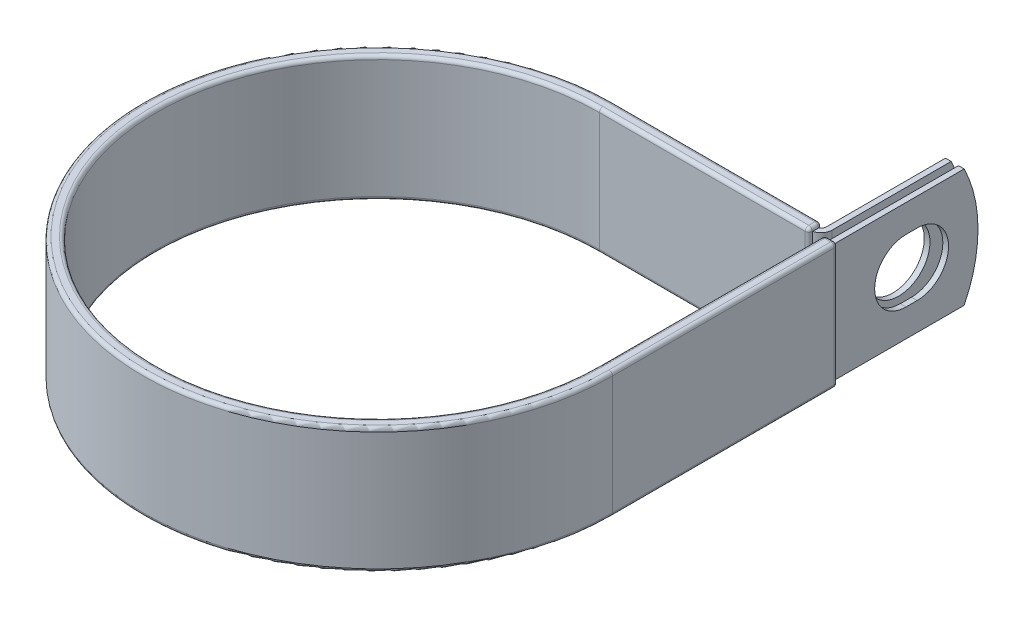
ISO-10303-21;
HEADER;
FILE_DESCRIPTION(('STEP AP214'),'2;1');
FILE_NAME('part.step','',(''),(''),'','','');
FILE_SCHEMA(('AUTOMOTIVE_DESIGN { 1 0 10303 214 1 1 1 1 }'));
ENDSEC;
DATA;
#1=APPLICATION_CONTEXT('core data for automotive mechanical design processes');
#2=APPLICATION_PROTOCOL_DEFINITION('international standard','automotive_design',2000,#1);
#3=PRODUCT_CONTEXT('',#1,'mechanical');
#4=PRODUCT('Part','Part','',(#3));
#5=PRODUCT_RELATED_PRODUCT_CATEGORY('part','',(#4));
#6=PRODUCT_DEFINITION_FORMATION('','',#4);
#7=PRODUCT_DEFINITION_CONTEXT('part definition',#1,'design');
#8=PRODUCT_DEFINITION('design','',#6,#7);
#9=PRODUCT_DEFINITION_SHAPE('','',#8);
#10=(LENGTH_UNIT() NAMED_UNIT(*) SI_UNIT(.MILLI.,.METRE.));
#11=(NAMED_UNIT(*) PLANE_ANGLE_UNIT() SI_UNIT($,.RADIAN.));
#12=(NAMED_UNIT(*) SI_UNIT($,.STERADIAN.) SOLID_ANGLE_UNIT());
#13=UNCERTAINTY_MEASURE_WITH_UNIT(LENGTH_MEASURE(1.E-05),#10,'distance_accuracy_value','');
#14=(GEOMETRIC_REPRESENTATION_CONTEXT(3) GLOBAL_UNCERTAINTY_ASSIGNED_CONTEXT((#13)) GLOBAL_UNIT_ASSIGNED_CONTEXT((#10,
#11,#12)) REPRESENTATION_CONTEXT('',''));
#15=CARTESIAN_POINT('',(0.,0.,0.));
#16=DIRECTION('',(0.,0.,1.));
#17=DIRECTION('',(1.,0.,0.));
#18=AXIS2_PLACEMENT_3D('',#15,#16,#17);
#19=CARTESIAN_POINT('',(46.84395,12.7,-79.3496));
#20=DIRECTION('',(1.,0.,0.));
#21=DIRECTION('',(0.,0.,-1.));
#22=AXIS2_PLACEMENT_3D('',#19,#20,#21);
#23=PLANE('',#22);
#24=CARTESIAN_POINT('',(46.84395,0.,-65.0748));
#25=DIRECTION('',(1.,0.,0.));
#26=DIRECTION('',(0.,0.,-1.));
#27=AXIS2_PLACEMENT_3D('',#24,#25,#26);
#28=CIRCLE('',#27,6.7437);
#29=CARTESIAN_POINT('',(46.84395,0.,-71.8185));
#30=VERTEX_POINT('',#29);
#31=EDGE_CURVE('E460',#30,#30,#28,.F.);
#32=ORIENTED_EDGE('',*,*,#31,.T.);
#33=EDGE_LOOP('',(#32));
#34=FACE_BOUND('',#33,.T.);
#35=DIRECTION('',(0.,0.,1.));
#36=VECTOR('',#35,1.);
#37=CARTESIAN_POINT('',(46.84395,-12.7,-79.3496));
#38=LINE('',#37,#36);
#39=CARTESIAN_POINT('',(46.84395,-12.7,-76.3722683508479));
#40=VERTEX_POINT('',#39);
#41=CARTESIAN_POINT('',(46.84395,-12.7,-50.79619));
#42=VERTEX_POINT('',#41);
#43=EDGE_CURVE('E482',#40,#42,#38,.T.);
#44=ORIENTED_EDGE('',*,*,#43,.F.);
#45=CARTESIAN_POINT('',(46.84395,0.,-50.7746));
#46=DIRECTION('',(1.,0.,0.));
#47=DIRECTION('',(0.,0.,-1.));
#48=AXIS2_PLACEMENT_3D('',#45,#46,#47);
#49=CIRCLE('',#48,28.575);
#50=CARTESIAN_POINT('',(46.84395,12.7,-76.3722683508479));
#51=VERTEX_POINT('',#50);
#52=EDGE_CURVE('E419',#40,#51,#49,.T.);
#53=ORIENTED_EDGE('',*,*,#52,.T.);
#54=DIRECTION('',(0.,0.,1.));
#55=VECTOR('',#54,1.);
#56=CARTESIAN_POINT('',(46.84395,12.7,-79.3496));
#57=LINE('',#56,#55);
#58=CARTESIAN_POINT('',(46.84395,12.7,-50.79619));
#59=VERTEX_POINT('',#58);
#60=EDGE_CURVE('E472',#51,#59,#57,.T.);
#61=ORIENTED_EDGE('',*,*,#60,.T.);
#62=DIRECTION('',(0.,-1.,0.));
#63=VECTOR('',#62,1.);
#64=CARTESIAN_POINT('',(46.84395,12.7,-50.79619));
#65=LINE('',#64,#63);
#66=EDGE_CURVE('E489',#59,#42,#65,.T.);
#67=ORIENTED_EDGE('',*,*,#66,.T.);
#68=EDGE_LOOP('',(#44,#53,#61,#67));
#69=FACE_BOUND('',#68,.T.);
#70=ADVANCED_FACE('F54',(#34,#69),#23,.T.);
#71=CARTESIAN_POINT('',(45.62475,12.7,-79.3496));
#72=DIRECTION('',(1.,0.,0.));
#73=DIRECTION('',(0.,0.,-1.));
#74=AXIS2_PLACEMENT_3D('',#71,#72,#73);
#75=PLANE('',#74);
#76=CARTESIAN_POINT('',(45.62475,0.,-65.0748));
#77=DIRECTION('',(-1.,0.,0.));
#78=DIRECTION('',(0.,0.,1.));
#79=AXIS2_PLACEMENT_3D('',#76,#77,#78);
#80=CIRCLE('',#79,6.7437);
#81=CARTESIAN_POINT('',(45.62475,0.,-58.3311));
#82=VERTEX_POINT('',#81);
#83=EDGE_CURVE('E457',#82,#82,#80,.T.);
#84=ORIENTED_EDGE('',*,*,#83,.F.);
#85=EDGE_LOOP('',(#84));
#86=FACE_BOUND('',#85,.T.);
#87=CARTESIAN_POINT('',(45.62475,0.,-50.7746));
#88=DIRECTION('',(-1.,0.,0.));
#89=DIRECTION('',(0.,0.,1.));
#90=AXIS2_PLACEMENT_3D('',#87,#88,#89);
#91=CIRCLE('',#90,28.575);
#92=CARTESIAN_POINT('',(45.62475,12.7,-76.3722683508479));
#93=VERTEX_POINT('',#92);
#94=CARTESIAN_POINT('',(45.62475,-12.7,-76.3722683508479));
#95=VERTEX_POINT('',#94);
#96=EDGE_CURVE('E411',#93,#95,#91,.T.);
#97=ORIENTED_EDGE('',*,*,#96,.T.);
#98=DIRECTION('',(0.,0.,1.));
#99=VECTOR('',#98,1.);
#100=CARTESIAN_POINT('',(45.62475,-12.7,-79.3496));
#101=LINE('',#100,#99);
#102=CARTESIAN_POINT('',(45.62475,-12.7,-50.79619));
#103=VERTEX_POINT('',#102);
#104=EDGE_CURVE('E484',#95,#103,#101,.T.);
#105=ORIENTED_EDGE('',*,*,#104,.T.);
#106=DIRECTION('',(0.,-1.,0.));
#107=VECTOR('',#106,1.);
#108=CARTESIAN_POINT('',(45.62475,12.7,-50.79619));
#109=LINE('',#108,#107);
#110=CARTESIAN_POINT('',(45.62475,12.7,-50.79619));
#111=VERTEX_POINT('',#110);
#112=EDGE_CURVE('E477',#111,#103,#109,.T.);
#113=ORIENTED_EDGE('',*,*,#112,.F.);
#114=DIRECTION('',(0.,0.,1.));
#115=VECTOR('',#114,1.);
#116=CARTESIAN_POINT('',(45.62475,12.7,-79.3496));
#117=LINE('',#116,#115);
#118=EDGE_CURVE('E474',#93,#111,#117,.T.);
#119=ORIENTED_EDGE('',*,*,#118,.F.);
#120=EDGE_LOOP('',(#97,#105,#113,#119));
#121=FACE_BOUND('',#120,.T.);
#122=ADVANCED_FACE('F788',(#86,#121),#75,.F.);
#123=CARTESIAN_POINT('',(0.,-12.7,0.));
#124=DIRECTION('',(0.,1.,0.));
#125=DIRECTION('',(1.,0.,0.));
#126=AXIS2_PLACEMENT_3D('',#123,#124,#125);
#127=PLANE('',#126);
#128=CARTESIAN_POINT('',(44.46651,-12.7,-50.79619));
#129=DIRECTION('',(0.,-1.,0.));
#130=DIRECTION('',(0.,0.,1.));
#131=AXIS2_PLACEMENT_3D('',#128,#129,#130);
#132=CIRCLE('',#131,2.37744);
#133=CARTESIAN_POINT('',(44.9897500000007,-12.7,-48.4770434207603));
#134=VERTEX_POINT('',#133);
#135=EDGE_CURVE('E479',#42,#134,#132,.T.);
#136=ORIENTED_EDGE('',*,*,#135,.T.);
#137=DIRECTION('',(0.,0.,-1.));
#138=VECTOR('',#137,1.);
#139=CARTESIAN_POINT('',(44.9897500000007,-12.7,-49.63795));
#140=LINE('',#139,#138);
#141=CARTESIAN_POINT('',(44.9897500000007,-12.7,-49.6697));
#142=VERTEX_POINT('',#141);
#143=EDGE_CURVE('E368',#134,#142,#140,.T.);
#144=ORIENTED_EDGE('',*,*,#143,.T.);
#145=CARTESIAN_POINT('',(44.2277500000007,-12.7,-49.6697));
#146=DIRECTION('',(0.,1.,0.));
#147=DIRECTION('',(0.,0.,1.));
#148=AXIS2_PLACEMENT_3D('',#145,#146,#147);
#149=CIRCLE('',#148,0.762);
#150=CARTESIAN_POINT('',(44.9843610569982,-12.7,-49.7601638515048));
#151=VERTEX_POINT('',#150);
#152=EDGE_CURVE('E554',#142,#151,#149,.T.);
#153=ORIENTED_EDGE('',*,*,#152,.T.);
#154=CARTESIAN_POINT('',(44.46651,-12.7,-50.79619));
#155=DIRECTION('',(0.,1.,0.));
#156=DIRECTION('',(1.,0.,0.));
#157=AXIS2_PLACEMENT_3D('',#154,#155,#156);
#158=CIRCLE('',#157,1.15824);
#159=EDGE_CURVE('E77',#103,#151,#158,.F.);
#160=ORIENTED_EDGE('',*,*,#159,.F.);
#161=ORIENTED_EDGE('',*,*,#104,.F.);
#162=DIRECTION('',(-1.,0.,0.));
#163=VECTOR('',#162,1.);
#164=CARTESIAN_POINT('',(49.63795,-12.7,-76.3722683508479));
#165=LINE('',#164,#163);
#166=EDGE_CURVE('E498',#40,#95,#165,.T.);
#167=ORIENTED_EDGE('',*,*,#166,.F.);
#168=ORIENTED_EDGE('',*,*,#43,.T.);
#169=EDGE_LOOP('',(#136,#144,#153,#160,#161,#167,#168));
#170=FACE_BOUND('',#169,.T.);
#171=ADVANCED_FACE('F794',(#170),#127,.F.);
#172=CARTESIAN_POINT('',(0.,12.7,0.));
#173=DIRECTION('',(0.,1.,0.));
#174=DIRECTION('',(1.,0.,0.));
#175=AXIS2_PLACEMENT_3D('',#172,#173,#174);
#176=PLANE('',#175);
#177=DIRECTION('',(0.,0.,-1.));
#178=VECTOR('',#177,1.);
#179=CARTESIAN_POINT('',(44.98975,12.7,6.31078317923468E-13));
#180=LINE('',#179,#178);
#181=CARTESIAN_POINT('',(44.9897500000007,12.7,-48.4770434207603));
#182=VERTEX_POINT('',#181);
#183=CARTESIAN_POINT('',(44.9897500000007,12.7,-49.6697));
#184=VERTEX_POINT('',#183);
#185=EDGE_CURVE('E405',#182,#184,#180,.T.);
#186=ORIENTED_EDGE('',*,*,#185,.F.);
#187=CARTESIAN_POINT('',(44.46651,12.7,-50.79619));
#188=DIRECTION('',(0.,-1.,0.));
#189=DIRECTION('',(0.,0.,1.));
#190=AXIS2_PLACEMENT_3D('',#187,#188,#189);
#191=CIRCLE('',#190,2.37744);
#192=EDGE_CURVE('E469',#59,#182,#191,.T.);
#193=ORIENTED_EDGE('',*,*,#192,.F.);
#194=ORIENTED_EDGE('',*,*,#60,.F.);
#195=DIRECTION('',(-1.,0.,0.));
#196=VECTOR('',#195,1.);
#197=CARTESIAN_POINT('',(49.63795,12.7,-76.3722683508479));
#198=LINE('',#197,#196);
#199=EDGE_CURVE('E495',#51,#93,#198,.T.);
#200=ORIENTED_EDGE('',*,*,#199,.T.);
#201=ORIENTED_EDGE('',*,*,#118,.T.);
#202=CARTESIAN_POINT('',(44.46651,12.7,-50.79619));
#203=DIRECTION('',(0.,1.,0.));
#204=DIRECTION('',(1.,0.,0.));
#205=AXIS2_PLACEMENT_3D('',#202,#203,#204);
#206=CIRCLE('',#205,1.15824);
#207=CARTESIAN_POINT('',(44.9843610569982,12.7,-49.7601638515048));
#208=VERTEX_POINT('',#207);
#209=EDGE_CURVE('E70',#111,#208,#206,.F.);
#210=ORIENTED_EDGE('',*,*,#209,.T.);
#211=CARTESIAN_POINT('',(44.2277500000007,12.7,-49.6697));
#212=DIRECTION('',(0.,1.,0.));
#213=DIRECTION('',(0.,0.,1.));
#214=AXIS2_PLACEMENT_3D('',#211,#212,#213);
#215=CIRCLE('',#214,0.762);
#216=EDGE_CURVE('E12',#208,#184,#215,.F.);
#217=ORIENTED_EDGE('',*,*,#216,.T.);
#218=EDGE_LOOP('',(#186,#193,#194,#200,#201,#210,#217));
#219=FACE_BOUND('',#218,.T.);
#220=ADVANCED_FACE('F802',(#219),#176,.T.);
#221=CARTESIAN_POINT('',(44.46651,12.7,-50.79619));
#222=DIRECTION('',(0.,-1.,0.));
#223=DIRECTION('',(0.,0.,-1.));
#224=AXIS2_PLACEMENT_3D('',#221,#222,#223);
#225=CYLINDRICAL_SURFACE('',#224,2.37744);
#226=ORIENTED_EDGE('',*,*,#135,.F.);
#227=ORIENTED_EDGE('',*,*,#66,.F.);
#228=ORIENTED_EDGE('',*,*,#192,.T.);
#229=CARTESIAN_POINT('',(44.46651,12.7,-50.79619));
#230=DIRECTION('',(0.,-1.,0.));
#231=DIRECTION('',(0.,0.,-1.));
#232=AXIS2_PLACEMENT_3D('',#229,#230,#231);
#233=CIRCLE('',#232,2.37744);
#234=CARTESIAN_POINT('',(44.46651,12.7,-48.41875));
#235=VERTEX_POINT('',#234);
#236=EDGE_CURVE('E402',#235,#182,#233,.F.);
#237=ORIENTED_EDGE('',*,*,#236,.F.);
#238=DIRECTION('',(0.,-1.,0.));
#239=VECTOR('',#238,1.);
#240=CARTESIAN_POINT('',(44.46651,12.7,-48.41875));
#241=LINE('',#240,#239);
#242=CARTESIAN_POINT('',(44.46651,-12.7,-48.41875));
#243=VERTEX_POINT('',#242);
#244=EDGE_CURVE('E492',#235,#243,#241,.T.);
#245=ORIENTED_EDGE('',*,*,#244,.T.);
#246=CARTESIAN_POINT('',(44.46651,-12.7,-50.79619));
#247=DIRECTION('',(0.,1.,0.));
#248=DIRECTION('',(0.,0.,1.));
#249=AXIS2_PLACEMENT_3D('',#246,#247,#248);
#250=CIRCLE('',#249,2.37744);
#251=EDGE_CURVE('E400',#134,#243,#250,.F.);
#252=ORIENTED_EDGE('',*,*,#251,.F.);
#253=EDGE_LOOP('',(#226,#227,#228,#237,#245,#252));
#254=FACE_BOUND('',#253,.T.);
#255=ADVANCED_FACE('F799',(#254),#225,.T.);
#256=CARTESIAN_POINT('',(44.46651,12.7,-50.79619));
#257=DIRECTION('',(0.,-1.,0.));
#258=DIRECTION('',(0.,0.,-1.));
#259=AXIS2_PLACEMENT_3D('',#256,#257,#258);
#260=CYLINDRICAL_SURFACE('',#259,1.15824);
#261=ORIENTED_EDGE('',*,*,#159,.T.);
#262=DIRECTION('',(0.,1.,0.));
#263=VECTOR('',#262,1.);
#264=CARTESIAN_POINT('',(44.9843610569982,-12.7,-49.7601638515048));
#265=LINE('',#264,#263);
#266=EDGE_CURVE('E63',#151,#208,#265,.T.);
#267=ORIENTED_EDGE('',*,*,#266,.T.);
#268=ORIENTED_EDGE('',*,*,#209,.F.);
#269=ORIENTED_EDGE('',*,*,#112,.T.);
#270=EDGE_LOOP('',(#261,#267,#268,#269));
#271=FACE_BOUND('',#270,.T.);
#272=ADVANCED_FACE('F801',(#271),#260,.F.);
#273=CARTESIAN_POINT('',(65.9180140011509,0.,-65.0748));
#274=DIRECTION('',(-1.,0.,0.));
#275=DIRECTION('',(0.,0.,1.));
#276=AXIS2_PLACEMENT_3D('',#273,#274,#275);
#277=CYLINDRICAL_SURFACE('',#276,6.7437);
#278=ORIENTED_EDGE('',*,*,#83,.T.);
#279=EDGE_LOOP('',(#278));
#280=FACE_BOUND('',#279,.T.);
#281=ORIENTED_EDGE('',*,*,#31,.F.);
#282=EDGE_LOOP('',(#281));
#283=FACE_BOUND('',#282,.T.);
#284=ADVANCED_FACE('F808',(#280,#283),#277,.F.);
#285=CARTESIAN_POINT('',(49.63795,0.,-50.7746));
#286=DIRECTION('',(-1.,0.,0.));
#287=DIRECTION('',(0.,0.,1.));
#288=AXIS2_PLACEMENT_3D('',#285,#286,#287);
#289=CYLINDRICAL_SURFACE('',#288,28.575);
#290=ORIENTED_EDGE('',*,*,#52,.F.);
#291=ORIENTED_EDGE('',*,*,#166,.T.);
#292=ORIENTED_EDGE('',*,*,#96,.F.);
#293=ORIENTED_EDGE('',*,*,#199,.F.);
#294=EDGE_LOOP('',(#290,#291,#292,#293));
#295=FACE_BOUND('',#294,.T.);
#296=ADVANCED_FACE('F859',(#295),#289,.T.);
#297=CARTESIAN_POINT('',(6.79177441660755E-13,-12.7,-48.41875));
#298=DIRECTION('',(0.,0.,1.));
#299=DIRECTION('',(1.,0.,0.));
#300=AXIS2_PLACEMENT_3D('',#297,#298,#299);
#301=PLANE('',#300);
#302=DIRECTION('',(1.,0.,0.));
#303=VECTOR('',#302,1.);
#304=CARTESIAN_POINT('',(6.79177441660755E-13,-12.7,-48.41875));
#305=LINE('',#304,#303);
#306=CARTESIAN_POINT('',(44.9897500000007,-12.7,-48.41875));
#307=VERTEX_POINT('',#306);
#308=EDGE_CURVE('E375',#243,#307,#305,.T.);
#309=ORIENTED_EDGE('',*,*,#308,.F.);
#310=ORIENTED_EDGE('',*,*,#244,.F.);
#311=DIRECTION('',(1.,0.,0.));
#312=VECTOR('',#311,1.);
#313=CARTESIAN_POINT('',(6.79177441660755E-13,12.7,-48.41875));
#314=LINE('',#313,#312);
#315=CARTESIAN_POINT('',(44.9897500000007,12.7,-48.41875));
#316=VERTEX_POINT('',#315);
#317=EDGE_CURVE('E377',#235,#316,#314,.T.);
#318=ORIENTED_EDGE('',*,*,#317,.T.);
#319=DIRECTION('',(0.,-1.,0.));
#320=VECTOR('',#319,1.);
#321=CARTESIAN_POINT('',(44.9897500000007,-12.7,-48.41875));
#322=LINE('',#321,#320);
#323=EDGE_CURVE('E307',#316,#307,#322,.T.);
#324=ORIENTED_EDGE('',*,*,#323,.T.);
#325=EDGE_LOOP('',(#309,#310,#318,#324));
#326=FACE_BOUND('',#325,.T.);
#327=ADVANCED_FACE('F831',(#326),#301,.F.);
#328=CARTESIAN_POINT('',(44.9897500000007,-12.73175,-48.387));
#329=DIRECTION('',(1.,0.,0.));
#330=DIRECTION('',(0.,0.,-1.));
#331=AXIS2_PLACEMENT_3D('',#328,#329,#330);
#332=PLANE('',#331);
#333=DIRECTION('',(0.,0.,-1.));
#334=VECTOR('',#333,1.);
#335=CARTESIAN_POINT('',(44.9897500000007,-12.73175,-49.6697));
#336=LINE('',#335,#334);
#337=CARTESIAN_POINT('',(44.9897500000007,-12.73175,-48.387));
#338=VERTEX_POINT('',#337);
#339=CARTESIAN_POINT('',(44.9897500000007,-12.73175,-49.6697));
#340=VERTEX_POINT('',#339);
#341=EDGE_CURVE('E508',#338,#340,#336,.T.);
#342=ORIENTED_EDGE('',*,*,#341,.T.);
#343=DIRECTION('',(0.,1.,0.));
#344=VECTOR('',#343,1.);
#345=CARTESIAN_POINT('',(44.9897500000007,-12.73175,-49.6697));
#346=LINE('',#345,#344);
#347=EDGE_CURVE('E512',#340,#142,#346,.T.);
#348=ORIENTED_EDGE('',*,*,#347,.T.);
#349=ORIENTED_EDGE('',*,*,#143,.F.);
#350=EDGE_CURVE('E369',#307,#134,#140,.T.);
#351=ORIENTED_EDGE('',*,*,#350,.F.);
#352=ORIENTED_EDGE('',*,*,#323,.F.);
#353=DIRECTION('',(0.,0.,1.));
#354=VECTOR('',#353,1.);
#355=CARTESIAN_POINT('',(44.9897500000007,12.7,-48.41875));
#356=LINE('',#355,#354);
#357=EDGE_CURVE('E372',#182,#316,#356,.T.);
#358=ORIENTED_EDGE('',*,*,#357,.F.);
#359=ORIENTED_EDGE('',*,*,#185,.T.);
#360=DIRECTION('',(0.,1.,0.));
#361=VECTOR('',#360,1.);
#362=CARTESIAN_POINT('',(44.9897500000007,-12.73175,-49.6697));
#363=LINE('',#362,#361);
#364=CARTESIAN_POINT('',(44.9897500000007,12.73175,-49.6697));
#365=VERTEX_POINT('',#364);
#366=EDGE_CURVE('E510',#184,#365,#363,.T.);
#367=ORIENTED_EDGE('',*,*,#366,.T.);
#368=DIRECTION('',(0.,0.,1.));
#369=VECTOR('',#368,1.);
#370=CARTESIAN_POINT('',(44.9897500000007,12.73175,-48.387));
#371=LINE('',#370,#369);
#372=CARTESIAN_POINT('',(44.9897500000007,12.73175,-48.387));
#373=VERTEX_POINT('',#372);
#374=EDGE_CURVE('E504',#365,#373,#371,.T.);
#375=ORIENTED_EDGE('',*,*,#374,.T.);
#376=DIRECTION('',(0.,-1.,0.));
#377=VECTOR('',#376,1.);
#378=CARTESIAN_POINT('',(44.9897500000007,-12.73175,-48.387));
#379=LINE('',#378,#377);
#380=EDGE_CURVE('E506',#373,#338,#379,.T.);
#381=ORIENTED_EDGE('',*,*,#380,.T.);
#382=EDGE_LOOP('',(#342,#348,#349,#351,#352,#358,#359,#367,#375,#381));
#383=FACE_BOUND('',#382,.T.);
#384=ADVANCED_FACE('F827',(#383),#332,.T.);
#385=CARTESIAN_POINT('',(6.96724714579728E-13,-12.73175,-49.6697));
#386=DIRECTION('',(1.,0.,0.));
#387=DIRECTION('',(0.,0.,-1.));
#388=AXIS2_PLACEMENT_3D('',#385,#386,#387);
#389=CYLINDRICAL_SURFACE('',#388,0.762000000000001);
#390=DIRECTION('',(1.,0.,0.));
#391=VECTOR('',#390,1.);
#392=CARTESIAN_POINT('',(7.07413408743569E-13,-12.73175,-50.4317));
#393=LINE('',#392,#391);
#394=CARTESIAN_POINT('',(7.07413408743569E-13,-12.73175,-50.4317));
#395=VERTEX_POINT('',#394);
#396=CARTESIAN_POINT('',(44.2277500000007,-12.73175,-50.4317));
#397=VERTEX_POINT('',#396);
#398=EDGE_CURVE('E394',#395,#397,#393,.T.);
#399=ORIENTED_EDGE('',*,*,#398,.T.);
#400=CARTESIAN_POINT('',(44.2277500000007,-12.73175,-49.6697));
#401=DIRECTION('',(1.,0.,0.));
#402=DIRECTION('',(0.,0.,-1.));
#403=AXIS2_PLACEMENT_3D('',#400,#401,#402);
#404=CIRCLE('',#403,0.762000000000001);
#405=CARTESIAN_POINT('',(44.2277500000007,-13.49375,-49.6697));
#406=VERTEX_POINT('',#405);
#407=EDGE_CURVE('E517',#397,#406,#404,.F.);
#408=ORIENTED_EDGE('',*,*,#407,.T.);
#409=DIRECTION('',(1.,0.,0.));
#410=VECTOR('',#409,1.);
#411=CARTESIAN_POINT('',(6.96724714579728E-13,-13.49375,-49.6697));
#412=LINE('',#411,#410);
#413=CARTESIAN_POINT('',(6.96724714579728E-13,-13.49375,-49.6697));
#414=VERTEX_POINT('',#413);
#415=EDGE_CURVE('E397',#414,#406,#412,.T.);
#416=ORIENTED_EDGE('',*,*,#415,.F.);
#417=CARTESIAN_POINT('',(6.96724714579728E-13,-12.73175,-49.6697));
#418=DIRECTION('',(1.,0.,0.));
#419=DIRECTION('',(0.,0.,1.));
#420=AXIS2_PLACEMENT_3D('',#417,#418,#419);
#421=CIRCLE('',#420,0.762000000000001);
#422=EDGE_CURVE('E345',#414,#395,#421,.T.);
#423=ORIENTED_EDGE('',*,*,#422,.T.);
#424=EDGE_LOOP('',(#399,#408,#416,#423));
#425=FACE_BOUND('',#424,.T.);
#426=ADVANCED_FACE('F670',(#425),#389,.T.);
#427=CARTESIAN_POINT('',(7.07413408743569E-13,12.73175,-50.4317));
#428=DIRECTION('',(0.,0.,-1.));
#429=DIRECTION('',(0.,1.,0.));
#430=AXIS2_PLACEMENT_3D('',#427,#428,#429);
#431=PLANE('',#430);
#432=DIRECTION('',(1.,0.,0.));
#433=VECTOR('',#432,1.);
#434=CARTESIAN_POINT('',(7.07413408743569E-13,12.73175,-50.4317));
#435=LINE('',#434,#433);
#436=CARTESIAN_POINT('',(7.07413408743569E-13,12.73175,-50.4317));
#437=VERTEX_POINT('',#436);
#438=CARTESIAN_POINT('',(44.2277500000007,12.73175,-50.4317));
#439=VERTEX_POINT('',#438);
#440=EDGE_CURVE('E391',#437,#439,#435,.T.);
#441=ORIENTED_EDGE('',*,*,#440,.T.);
#442=DIRECTION('',(0.,1.,0.));
#443=VECTOR('',#442,1.);
#444=CARTESIAN_POINT('',(44.2277500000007,12.73175,-50.4317));
#445=LINE('',#444,#443);
#446=EDGE_CURVE('E515',#439,#397,#445,.F.);
#447=ORIENTED_EDGE('',*,*,#446,.T.);
#448=ORIENTED_EDGE('',*,*,#398,.F.);
#449=DIRECTION('',(0.,1.,0.));
#450=VECTOR('',#449,1.);
#451=CARTESIAN_POINT('',(7.07413408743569E-13,12.73175,-50.4317));
#452=LINE('',#451,#450);
#453=EDGE_CURVE('E342',#395,#437,#452,.T.);
#454=ORIENTED_EDGE('',*,*,#453,.T.);
#455=EDGE_LOOP('',(#441,#447,#448,#454));
#456=FACE_BOUND('',#455,.T.);
#457=ADVANCED_FACE('F676',(#456),#431,.T.);
#458=CARTESIAN_POINT('',(6.96724714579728E-13,12.73175,-49.6697));
#459=DIRECTION('',(1.,0.,0.));
#460=DIRECTION('',(0.,0.,-1.));
#461=AXIS2_PLACEMENT_3D('',#458,#459,#460);
#462=CYLINDRICAL_SURFACE('',#461,0.762000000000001);
#463=DIRECTION('',(1.,0.,0.));
#464=VECTOR('',#463,1.);
#465=CARTESIAN_POINT('',(6.96724714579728E-13,13.49375,-49.6697));
#466=LINE('',#465,#464);
#467=CARTESIAN_POINT('',(6.96724714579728E-13,13.49375,-49.6697));
#468=VERTEX_POINT('',#467);
#469=CARTESIAN_POINT('',(44.2277500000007,13.49375,-49.6697));
#470=VERTEX_POINT('',#469);
#471=EDGE_CURVE('E388',#468,#470,#466,.T.);
#472=ORIENTED_EDGE('',*,*,#471,.T.);
#473=CARTESIAN_POINT('',(44.2277500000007,12.73175,-49.6697));
#474=DIRECTION('',(1.,0.,0.));
#475=DIRECTION('',(0.,0.,-1.));
#476=AXIS2_PLACEMENT_3D('',#473,#474,#475);
#477=CIRCLE('',#476,0.762000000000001);
#478=EDGE_CURVE('E501',#470,#439,#477,.F.);
#479=ORIENTED_EDGE('',*,*,#478,.T.);
#480=ORIENTED_EDGE('',*,*,#440,.F.);
#481=CARTESIAN_POINT('',(6.96724714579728E-13,12.73175,-49.6697));
#482=DIRECTION('',(1.,0.,0.));
#483=DIRECTION('',(0.,0.,1.));
#484=AXIS2_PLACEMENT_3D('',#481,#482,#483);
#485=CIRCLE('',#484,0.762000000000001);
#486=EDGE_CURVE('E339',#437,#468,#485,.T.);
#487=ORIENTED_EDGE('',*,*,#486,.T.);
#488=EDGE_LOOP('',(#472,#479,#480,#487));
#489=FACE_BOUND('',#488,.T.);
#490=ADVANCED_FACE('F680',(#489),#462,.T.);
#491=CARTESIAN_POINT('',(6.78732079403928E-13,12.73175,-48.387));
#492=DIRECTION('',(1.,0.,0.));
#493=DIRECTION('',(0.,0.,-1.));
#494=AXIS2_PLACEMENT_3D('',#491,#492,#493);
#495=CYLINDRICAL_SURFACE('',#494,0.761999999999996);
#496=DIRECTION('',(1.,0.,0.));
#497=VECTOR('',#496,1.);
#498=CARTESIAN_POINT('',(6.68043385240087E-13,12.73175,-47.625));
#499=LINE('',#498,#497);
#500=CARTESIAN_POINT('',(6.68043385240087E-13,12.73175,-47.625));
#501=VERTEX_POINT('',#500);
#502=CARTESIAN_POINT('',(44.2277500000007,12.73175,-47.625));
#503=VERTEX_POINT('',#502);
#504=EDGE_CURVE('E382',#501,#503,#499,.T.);
#505=ORIENTED_EDGE('',*,*,#504,.T.);
#506=CARTESIAN_POINT('',(44.2277500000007,12.73175,-48.387));
#507=DIRECTION('',(1.,0.,0.));
#508=DIRECTION('',(0.,0.,-1.));
#509=AXIS2_PLACEMENT_3D('',#506,#507,#508);
#510=CIRCLE('',#509,0.761999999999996);
#511=CARTESIAN_POINT('',(44.2277500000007,13.49375,-48.387));
#512=VERTEX_POINT('',#511);
#513=EDGE_CURVE('E527',#503,#512,#510,.F.);
#514=ORIENTED_EDGE('',*,*,#513,.T.);
#515=DIRECTION('',(1.,0.,0.));
#516=VECTOR('',#515,1.);
#517=CARTESIAN_POINT('',(6.78732079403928E-13,13.49375,-48.387));
#518=LINE('',#517,#516);
#519=CARTESIAN_POINT('',(6.78732079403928E-13,13.49375,-48.387));
#520=VERTEX_POINT('',#519);
#521=EDGE_CURVE('E385',#520,#512,#518,.T.);
#522=ORIENTED_EDGE('',*,*,#521,.F.);
#523=CARTESIAN_POINT('',(6.78732079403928E-13,12.73175,-48.387));
#524=DIRECTION('',(1.,0.,0.));
#525=DIRECTION('',(0.,0.,1.));
#526=AXIS2_PLACEMENT_3D('',#523,#524,#525);
#527=CIRCLE('',#526,0.761999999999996);
#528=EDGE_CURVE('E336',#520,#501,#527,.T.);
#529=ORIENTED_EDGE('',*,*,#528,.T.);
#530=EDGE_LOOP('',(#505,#514,#522,#529));
#531=FACE_BOUND('',#530,.T.);
#532=ADVANCED_FACE('F721',(#531),#495,.T.);
#533=CARTESIAN_POINT('',(6.68043385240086E-13,-12.73175,-47.625));
#534=DIRECTION('',(0.,0.,1.));
#535=DIRECTION('',(0.,-1.,0.));
#536=AXIS2_PLACEMENT_3D('',#533,#534,#535);
#537=PLANE('',#536);
#538=DIRECTION('',(1.,0.,0.));
#539=VECTOR('',#538,1.);
#540=CARTESIAN_POINT('',(6.68043385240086E-13,-12.73175,-47.625));
#541=LINE('',#540,#539);
#542=CARTESIAN_POINT('',(6.68043385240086E-13,-12.73175,-47.625));
#543=VERTEX_POINT('',#542);
#544=CARTESIAN_POINT('',(44.2277500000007,-12.73175,-47.625));
#545=VERTEX_POINT('',#544);
#546=EDGE_CURVE('E379',#543,#545,#541,.T.);
#547=ORIENTED_EDGE('',*,*,#546,.T.);
#548=DIRECTION('',(0.,-1.,0.));
#549=VECTOR('',#548,1.);
#550=CARTESIAN_POINT('',(44.2277500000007,-12.73175,-47.625));
#551=LINE('',#550,#549);
#552=EDGE_CURVE('E525',#545,#503,#551,.F.);
#553=ORIENTED_EDGE('',*,*,#552,.T.);
#554=ORIENTED_EDGE('',*,*,#504,.F.);
#555=DIRECTION('',(0.,-1.,0.));
#556=VECTOR('',#555,1.);
#557=CARTESIAN_POINT('',(6.68043385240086E-13,-12.73175,-47.625));
#558=LINE('',#557,#556);
#559=EDGE_CURVE('E327',#501,#543,#558,.T.);
#560=ORIENTED_EDGE('',*,*,#559,.T.);
#561=EDGE_LOOP('',(#547,#553,#554,#560));
#562=FACE_BOUND('',#561,.T.);
#563=ADVANCED_FACE('F719',(#562),#537,.T.);
#564=CARTESIAN_POINT('',(6.78732079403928E-13,-12.73175,-48.387));
#565=DIRECTION('',(1.,0.,0.));
#566=DIRECTION('',(0.,0.,-1.));
#567=AXIS2_PLACEMENT_3D('',#564,#565,#566);
#568=CYLINDRICAL_SURFACE('',#567,0.762000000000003);
#569=DIRECTION('',(1.,0.,0.));
#570=VECTOR('',#569,1.);
#571=CARTESIAN_POINT('',(6.78732079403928E-13,-13.49375,-48.387));
#572=LINE('',#571,#570);
#573=CARTESIAN_POINT('',(6.78732079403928E-13,-13.49375,-48.387));
#574=VERTEX_POINT('',#573);
#575=CARTESIAN_POINT('',(44.2277500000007,-13.49375,-48.387));
#576=VERTEX_POINT('',#575);
#577=EDGE_CURVE('E303',#574,#576,#572,.T.);
#578=ORIENTED_EDGE('',*,*,#577,.T.);
#579=CARTESIAN_POINT('',(44.2277500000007,-12.73175,-48.387));
#580=DIRECTION('',(1.,0.,0.));
#581=DIRECTION('',(0.,0.,-1.));
#582=AXIS2_PLACEMENT_3D('',#579,#580,#581);
#583=CIRCLE('',#582,0.762000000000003);
#584=EDGE_CURVE('E523',#576,#545,#583,.F.);
#585=ORIENTED_EDGE('',*,*,#584,.T.);
#586=ORIENTED_EDGE('',*,*,#546,.F.);
#587=CARTESIAN_POINT('',(6.78732079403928E-13,-12.73175,-48.387));
#588=DIRECTION('',(1.,0.,0.));
#589=DIRECTION('',(0.,0.,-1.));
#590=AXIS2_PLACEMENT_3D('',#587,#588,#589);
#591=CIRCLE('',#590,0.762000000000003);
#592=EDGE_CURVE('E324',#543,#574,#591,.T.);
#593=ORIENTED_EDGE('',*,*,#592,.T.);
#594=EDGE_LOOP('',(#578,#585,#586,#593));
#595=FACE_BOUND('',#594,.T.);
#596=ADVANCED_FACE('F709',(#595),#568,.T.);
#597=CARTESIAN_POINT('',(0.,-12.73175,0.));
#598=DIRECTION('',(0.,-1.,0.));
#599=DIRECTION('',(0.,0.,-1.));
#600=AXIS2_PLACEMENT_3D('',#597,#598,#599);
#601=TOROIDAL_SURFACE('',#600,49.6697,0.762000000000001);
#602=CARTESIAN_POINT('',(49.6697,-12.73175,0.));
#603=DIRECTION('',(0.,0.,1.));
#604=DIRECTION('',(-1.,0.,0.));
#605=AXIS2_PLACEMENT_3D('',#602,#603,#604);
#606=CIRCLE('',#605,0.762000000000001);
#607=CARTESIAN_POINT('',(49.6697,-13.49375,0.));
#608=VERTEX_POINT('',#607);
#609=CARTESIAN_POINT('',(50.4317,-12.73175,0.));
#610=VERTEX_POINT('',#609);
#611=EDGE_CURVE('E318',#608,#610,#606,.T.);
#612=ORIENTED_EDGE('',*,*,#611,.T.);
#613=CARTESIAN_POINT('',(0.,-12.73175,0.));
#614=DIRECTION('',(0.,-1.,0.));
#615=DIRECTION('',(0.,0.,-1.));
#616=AXIS2_PLACEMENT_3D('',#613,#614,#615);
#617=CIRCLE('',#616,50.4317);
#618=EDGE_CURVE('E361',#610,#395,#617,.T.);
#619=ORIENTED_EDGE('',*,*,#618,.T.);
#620=ORIENTED_EDGE('',*,*,#422,.F.);
#621=CARTESIAN_POINT('',(0.,-13.49375,0.));
#622=DIRECTION('',(0.,-1.,0.));
#623=DIRECTION('',(0.,0.,-1.));
#624=AXIS2_PLACEMENT_3D('',#621,#622,#623);
#625=CIRCLE('',#624,49.6697);
#626=EDGE_CURVE('E308',#608,#414,#625,.T.);
#627=ORIENTED_EDGE('',*,*,#626,.F.);
#628=EDGE_LOOP('',(#612,#619,#620,#627));
#629=FACE_BOUND('',#628,.T.);
#630=ADVANCED_FACE('F667',(#629),#601,.T.);
#631=CARTESIAN_POINT('',(0.,12.7,0.));
#632=DIRECTION('',(0.,-1.,0.));
#633=DIRECTION('',(0.,0.,-1.));
#634=AXIS2_PLACEMENT_3D('',#631,#632,#633);
#635=CYLINDRICAL_SURFACE('',#634,50.4317);
#636=DIRECTION('',(0.,1.,0.));
#637=VECTOR('',#636,1.);
#638=CARTESIAN_POINT('',(50.4317,12.73175,0.));
#639=LINE('',#638,#637);
#640=CARTESIAN_POINT('',(50.4317,12.73175,0.));
#641=VERTEX_POINT('',#640);
#642=EDGE_CURVE('E655',#610,#641,#639,.T.);
#643=ORIENTED_EDGE('',*,*,#642,.T.);
#644=CARTESIAN_POINT('',(0.,12.73175,0.));
#645=DIRECTION('',(0.,-1.,0.));
#646=DIRECTION('',(0.,0.,-1.));
#647=AXIS2_PLACEMENT_3D('',#644,#645,#646);
#648=CIRCLE('',#647,50.4317);
#649=EDGE_CURVE('E358',#641,#437,#648,.T.);
#650=ORIENTED_EDGE('',*,*,#649,.T.);
#651=ORIENTED_EDGE('',*,*,#453,.F.);
#652=ORIENTED_EDGE('',*,*,#618,.F.);
#653=EDGE_LOOP('',(#643,#650,#651,#652));
#654=FACE_BOUND('',#653,.T.);
#655=ADVANCED_FACE('F673',(#654),#635,.T.);
#656=CARTESIAN_POINT('',(0.,12.73175,0.));
#657=DIRECTION('',(0.,-1.,0.));
#658=DIRECTION('',(0.,0.,-1.));
#659=AXIS2_PLACEMENT_3D('',#656,#657,#658);
#660=TOROIDAL_SURFACE('',#659,49.6697,0.762000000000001);
#661=CARTESIAN_POINT('',(49.6697,12.73175,0.));
#662=DIRECTION('',(0.,0.,1.));
#663=DIRECTION('',(-1.,0.,0.));
#664=AXIS2_PLACEMENT_3D('',#661,#662,#663);
#665=CIRCLE('',#664,0.762000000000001);
#666=CARTESIAN_POINT('',(49.6697,13.49375,0.));
#667=VERTEX_POINT('',#666);
#668=EDGE_CURVE('E734',#641,#667,#665,.T.);
#669=ORIENTED_EDGE('',*,*,#668,.T.);
#670=CARTESIAN_POINT('',(0.,13.49375,0.));
#671=DIRECTION('',(0.,-1.,0.));
#672=DIRECTION('',(0.,0.,-1.));
#673=AXIS2_PLACEMENT_3D('',#670,#671,#672);
#674=CIRCLE('',#673,49.6697);
#675=EDGE_CURVE('E355',#667,#468,#674,.T.);
#676=ORIENTED_EDGE('',*,*,#675,.T.);
#677=ORIENTED_EDGE('',*,*,#486,.F.);
#678=ORIENTED_EDGE('',*,*,#649,.F.);
#679=EDGE_LOOP('',(#669,#676,#677,#678));
#680=FACE_BOUND('',#679,.T.);
#681=ADVANCED_FACE('F678',(#680),#660,.T.);
#682=CARTESIAN_POINT('',(0.,12.73175,0.));
#683=DIRECTION('',(0.,-1.,0.));
#684=DIRECTION('',(0.,0.,-1.));
#685=AXIS2_PLACEMENT_3D('',#682,#683,#684);
#686=TOROIDAL_SURFACE('',#685,48.387,0.761999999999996);
#687=CARTESIAN_POINT('',(48.387,12.73175,0.));
#688=DIRECTION('',(0.,0.,1.));
#689=DIRECTION('',(-1.,0.,0.));
#690=AXIS2_PLACEMENT_3D('',#687,#688,#689);
#691=CIRCLE('',#690,0.761999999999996);
#692=CARTESIAN_POINT('',(48.387,13.49375,0.));
#693=VERTEX_POINT('',#692);
#694=CARTESIAN_POINT('',(47.625,12.73175,0.));
#695=VERTEX_POINT('',#694);
#696=EDGE_CURVE('E730',#693,#695,#691,.T.);
#697=ORIENTED_EDGE('',*,*,#696,.T.);
#698=CARTESIAN_POINT('',(0.,12.73175,0.));
#699=DIRECTION('',(0.,-1.,0.));
#700=DIRECTION('',(0.,0.,-1.));
#701=AXIS2_PLACEMENT_3D('',#698,#699,#700);
#702=CIRCLE('',#701,47.625);
#703=EDGE_CURVE('E349',#695,#501,#702,.T.);
#704=ORIENTED_EDGE('',*,*,#703,.T.);
#705=ORIENTED_EDGE('',*,*,#528,.F.);
#706=CARTESIAN_POINT('',(0.,13.49375,0.));
#707=DIRECTION('',(0.,-1.,0.));
#708=DIRECTION('',(0.,0.,-1.));
#709=AXIS2_PLACEMENT_3D('',#706,#707,#708);
#710=CIRCLE('',#709,48.387);
#711=EDGE_CURVE('E352',#693,#520,#710,.T.);
#712=ORIENTED_EDGE('',*,*,#711,.F.);
#713=EDGE_LOOP('',(#697,#704,#705,#712));
#714=FACE_BOUND('',#713,.T.);
#715=ADVANCED_FACE('F728',(#714),#686,.T.);
#716=CARTESIAN_POINT('',(0.,12.7,0.));
#717=DIRECTION('',(0.,-1.,0.));
#718=DIRECTION('',(0.,0.,-1.));
#719=AXIS2_PLACEMENT_3D('',#716,#717,#718);
#720=CYLINDRICAL_SURFACE('',#719,47.625);
#721=DIRECTION('',(0.,-1.,0.));
#722=VECTOR('',#721,1.);
#723=CARTESIAN_POINT('',(47.625,-12.73175,0.));
#724=LINE('',#723,#722);
#725=CARTESIAN_POINT('',(47.625,-12.73175,0.));
#726=VERTEX_POINT('',#725);
#727=EDGE_CURVE('E733',#695,#726,#724,.T.);
#728=ORIENTED_EDGE('',*,*,#727,.T.);
#729=CARTESIAN_POINT('',(0.,-12.73175,0.));
#730=DIRECTION('',(0.,-1.,0.));
#731=DIRECTION('',(0.,0.,-1.));
#732=AXIS2_PLACEMENT_3D('',#729,#730,#731);
#733=CIRCLE('',#732,47.625);
#734=EDGE_CURVE('E314',#726,#543,#733,.T.);
#735=ORIENTED_EDGE('',*,*,#734,.T.);
#736=ORIENTED_EDGE('',*,*,#559,.F.);
#737=ORIENTED_EDGE('',*,*,#703,.F.);
#738=EDGE_LOOP('',(#728,#735,#736,#737));
#739=FACE_BOUND('',#738,.T.);
#740=ADVANCED_FACE('F726',(#739),#720,.F.);
#741=CARTESIAN_POINT('',(0.,-12.73175,0.));
#742=DIRECTION('',(0.,-1.,0.));
#743=DIRECTION('',(0.,0.,-1.));
#744=AXIS2_PLACEMENT_3D('',#741,#742,#743);
#745=TOROIDAL_SURFACE('',#744,48.387,0.762000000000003);
#746=CARTESIAN_POINT('',(48.387,-12.73175,0.));
#747=DIRECTION('',(0.,0.,1.));
#748=DIRECTION('',(1.,0.,0.));
#749=AXIS2_PLACEMENT_3D('',#746,#747,#748);
#750=CIRCLE('',#749,0.762000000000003);
#751=CARTESIAN_POINT('',(48.387,-13.49375,0.));
#752=VERTEX_POINT('',#751);
#753=EDGE_CURVE('E311',#726,#752,#750,.T.);
#754=ORIENTED_EDGE('',*,*,#753,.T.);
#755=CARTESIAN_POINT('',(0.,-13.49375,0.));
#756=DIRECTION('',(0.,-1.,0.));
#757=DIRECTION('',(0.,0.,-1.));
#758=AXIS2_PLACEMENT_3D('',#755,#756,#757);
#759=CIRCLE('',#758,48.387);
#760=EDGE_CURVE('E295',#752,#574,#759,.T.);
#761=ORIENTED_EDGE('',*,*,#760,.T.);
#762=ORIENTED_EDGE('',*,*,#592,.F.);
#763=ORIENTED_EDGE('',*,*,#734,.F.);
#764=EDGE_LOOP('',(#754,#761,#762,#763));
#765=FACE_BOUND('',#764,.T.);
#766=ADVANCED_FACE('F312',(#765),#745,.T.);
#767=CARTESIAN_POINT('',(48.387,-12.73175,0.));
#768=DIRECTION('',(0.,0.,-1.));
#769=DIRECTION('',(-1.,0.,0.));
#770=AXIS2_PLACEMENT_3D('',#767,#768,#769);
#771=CYLINDRICAL_SURFACE('',#770,0.762000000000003);
#772=DIRECTION('',(0.,0.,-1.));
#773=VECTOR('',#772,1.);
#774=CARTESIAN_POINT('',(47.625,-12.73175,0.));
#775=LINE('',#774,#773);
#776=CARTESIAN_POINT('',(47.625,-12.73175,-47.65675));
#777=VERTEX_POINT('',#776);
#778=EDGE_CURVE('E741',#726,#777,#775,.T.);
#779=ORIENTED_EDGE('',*,*,#778,.T.);
#780=CARTESIAN_POINT('',(48.387,-12.73175,-47.65675));
#781=DIRECTION('',(0.,0.,-1.));
#782=DIRECTION('',(-1.,0.,0.));
#783=AXIS2_PLACEMENT_3D('',#780,#781,#782);
#784=CIRCLE('',#783,0.762000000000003);
#785=CARTESIAN_POINT('',(48.387,-13.49375,-47.65675));
#786=VERTEX_POINT('',#785);
#787=EDGE_CURVE('E323',#777,#786,#784,.F.);
#788=ORIENTED_EDGE('',*,*,#787,.T.);
#789=DIRECTION('',(0.,0.,-1.));
#790=VECTOR('',#789,1.);
#791=CARTESIAN_POINT('',(48.387,-13.49375,0.));
#792=LINE('',#791,#790);
#793=EDGE_CURVE('E300',#752,#786,#792,.T.);
#794=ORIENTED_EDGE('',*,*,#793,.F.);
#795=ORIENTED_EDGE('',*,*,#753,.F.);
#796=EDGE_LOOP('',(#779,#788,#794,#795));
#797=FACE_BOUND('',#796,.T.);
#798=ADVANCED_FACE('F321',(#797),#771,.T.);
#799=CARTESIAN_POINT('',(49.6697,-13.49375,0.));
#800=DIRECTION('',(0.,1.,0.));
#801=DIRECTION('',(0.,0.,1.));
#802=AXIS2_PLACEMENT_3D('',#799,#800,#801);
#803=PLANE('',#802);
#804=ORIENTED_EDGE('',*,*,#415,.T.);
#805=DIRECTION('',(0.,0.,-1.));
#806=VECTOR('',#805,1.);
#807=CARTESIAN_POINT('',(44.2277500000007,-13.49375,-48.387));
#808=LINE('',#807,#806);
#809=EDGE_CURVE('E521',#406,#576,#808,.F.);
#810=ORIENTED_EDGE('',*,*,#809,.T.);
#811=ORIENTED_EDGE('',*,*,#577,.F.);
#812=ORIENTED_EDGE('',*,*,#760,.F.);
#813=ORIENTED_EDGE('',*,*,#793,.T.);
#814=DIRECTION('',(1.,0.,0.));
#815=VECTOR('',#814,1.);
#816=CARTESIAN_POINT('',(49.6697,-13.49375,-47.65675));
#817=LINE('',#816,#815);
#818=CARTESIAN_POINT('',(49.6697,-13.49375,-47.65675));
#819=VERTEX_POINT('',#818);
#820=EDGE_CURVE('E519',#786,#819,#817,.T.);
#821=ORIENTED_EDGE('',*,*,#820,.T.);
#822=DIRECTION('',(0.,0.,-1.));
#823=VECTOR('',#822,1.);
#824=CARTESIAN_POINT('',(49.6697,-13.49375,0.));
#825=LINE('',#824,#823);
#826=EDGE_CURVE('E325',#608,#819,#825,.T.);
#827=ORIENTED_EDGE('',*,*,#826,.F.);
#828=ORIENTED_EDGE('',*,*,#626,.T.);
#829=EDGE_LOOP('',(#804,#810,#811,#812,#813,#821,#827,#828));
#830=FACE_BOUND('',#829,.T.);
#831=ADVANCED_FACE('F298',(#830),#803,.F.);
#832=CARTESIAN_POINT('',(49.6697,-12.73175,0.));
#833=DIRECTION('',(0.,0.,-1.));
#834=DIRECTION('',(-1.,0.,0.));
#835=AXIS2_PLACEMENT_3D('',#832,#833,#834);
#836=CYLINDRICAL_SURFACE('',#835,0.762000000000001);
#837=ORIENTED_EDGE('',*,*,#826,.T.);
#838=CARTESIAN_POINT('',(49.6697,-12.73175,-47.65675));
#839=DIRECTION('',(0.,0.,-1.));
#840=DIRECTION('',(-1.,0.,0.));
#841=AXIS2_PLACEMENT_3D('',#838,#839,#840);
#842=CIRCLE('',#841,0.762000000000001);
#843=CARTESIAN_POINT('',(50.4317,-12.73175,-47.65675));
#844=VERTEX_POINT('',#843);
#845=EDGE_CURVE('E543',#819,#844,#842,.F.);
#846=ORIENTED_EDGE('',*,*,#845,.T.);
#847=DIRECTION('',(0.,0.,-1.));
#848=VECTOR('',#847,1.);
#849=CARTESIAN_POINT('',(50.4317,-12.73175,0.));
#850=LINE('',#849,#848);
#851=EDGE_CURVE('E330',#610,#844,#850,.T.);
#852=ORIENTED_EDGE('',*,*,#851,.F.);
#853=ORIENTED_EDGE('',*,*,#611,.F.);
#854=EDGE_LOOP('',(#837,#846,#852,#853));
#855=FACE_BOUND('',#854,.T.);
#856=ADVANCED_FACE('F661',(#855),#836,.T.);
#857=CARTESIAN_POINT('',(50.4317,12.73175,0.));
#858=DIRECTION('',(-1.,0.,0.));
#859=DIRECTION('',(0.,-1.,0.));
#860=AXIS2_PLACEMENT_3D('',#857,#858,#859);
#861=PLANE('',#860);
#862=ORIENTED_EDGE('',*,*,#851,.T.);
#863=DIRECTION('',(0.,1.,0.));
#864=VECTOR('',#863,1.);
#865=CARTESIAN_POINT('',(50.4317,12.73175,-47.65675));
#866=LINE('',#865,#864);
#867=CARTESIAN_POINT('',(50.4317,12.73175,-47.65675));
#868=VERTEX_POINT('',#867);
#869=EDGE_CURVE('E532',#844,#868,#866,.T.);
#870=ORIENTED_EDGE('',*,*,#869,.T.);
#871=DIRECTION('',(0.,0.,-1.));
#872=VECTOR('',#871,1.);
#873=CARTESIAN_POINT('',(50.4317,12.73175,0.));
#874=LINE('',#873,#872);
#875=EDGE_CURVE('E640',#641,#868,#874,.T.);
#876=ORIENTED_EDGE('',*,*,#875,.F.);
#877=ORIENTED_EDGE('',*,*,#642,.F.);
#878=EDGE_LOOP('',(#862,#870,#876,#877));
#879=FACE_BOUND('',#878,.T.);
#880=ADVANCED_FACE('F653',(#879),#861,.F.);
#881=CARTESIAN_POINT('',(49.6697,12.73175,0.));
#882=DIRECTION('',(0.,0.,-1.));
#883=DIRECTION('',(-1.,0.,0.));
#884=AXIS2_PLACEMENT_3D('',#881,#882,#883);
#885=CYLINDRICAL_SURFACE('',#884,0.762000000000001);
#886=ORIENTED_EDGE('',*,*,#875,.T.);
#887=CARTESIAN_POINT('',(49.6697,12.73175,-47.65675));
#888=DIRECTION('',(0.,0.,-1.));
#889=DIRECTION('',(-1.,0.,0.));
#890=AXIS2_PLACEMENT_3D('',#887,#888,#889);
#891=CIRCLE('',#890,0.762000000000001);
#892=CARTESIAN_POINT('',(49.6697,13.49375,-47.65675));
#893=VERTEX_POINT('',#892);
#894=EDGE_CURVE('E529',#868,#893,#891,.F.);
#895=ORIENTED_EDGE('',*,*,#894,.T.);
#896=DIRECTION('',(0.,0.,-1.));
#897=VECTOR('',#896,1.);
#898=CARTESIAN_POINT('',(49.6697,13.49375,0.));
#899=LINE('',#898,#897);
#900=EDGE_CURVE('E638',#667,#893,#899,.T.);
#901=ORIENTED_EDGE('',*,*,#900,.F.);
#902=ORIENTED_EDGE('',*,*,#668,.F.);
#903=EDGE_LOOP('',(#886,#895,#901,#902));
#904=FACE_BOUND('',#903,.T.);
#905=ADVANCED_FACE('F636',(#904),#885,.T.);
#906=CARTESIAN_POINT('',(48.387,13.49375,0.));
#907=DIRECTION('',(0.,-1.,0.));
#908=DIRECTION('',(0.,0.,-1.));
#909=AXIS2_PLACEMENT_3D('',#906,#907,#908);
#910=PLANE('',#909);
#911=ORIENTED_EDGE('',*,*,#521,.T.);
#912=DIRECTION('',(0.,0.,1.));
#913=VECTOR('',#912,1.);
#914=CARTESIAN_POINT('',(44.2277500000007,13.49375,-49.6697));
#915=LINE('',#914,#913);
#916=EDGE_CURVE('E552',#512,#470,#915,.F.);
#917=ORIENTED_EDGE('',*,*,#916,.T.);
#918=ORIENTED_EDGE('',*,*,#471,.F.);
#919=ORIENTED_EDGE('',*,*,#675,.F.);
#920=ORIENTED_EDGE('',*,*,#900,.T.);
#921=DIRECTION('',(-1.,0.,0.));
#922=VECTOR('',#921,1.);
#923=CARTESIAN_POINT('',(48.387,13.49375,-47.65675));
#924=LINE('',#923,#922);
#925=CARTESIAN_POINT('',(48.387,13.49375,-47.65675));
#926=VERTEX_POINT('',#925);
#927=EDGE_CURVE('E550',#893,#926,#924,.T.);
#928=ORIENTED_EDGE('',*,*,#927,.T.);
#929=DIRECTION('',(0.,0.,-1.));
#930=VECTOR('',#929,1.);
#931=CARTESIAN_POINT('',(48.387,13.49375,0.));
#932=LINE('',#931,#930);
#933=EDGE_CURVE('E643',#693,#926,#932,.T.);
#934=ORIENTED_EDGE('',*,*,#933,.F.);
#935=ORIENTED_EDGE('',*,*,#711,.T.);
#936=EDGE_LOOP('',(#911,#917,#918,#919,#920,#928,#934,#935));
#937=FACE_BOUND('',#936,.T.);
#938=ADVANCED_FACE('F641',(#937),#910,.F.);
#939=CARTESIAN_POINT('',(48.387,12.73175,0.));
#940=DIRECTION('',(0.,0.,-1.));
#941=DIRECTION('',(-1.,0.,0.));
#942=AXIS2_PLACEMENT_3D('',#939,#940,#941);
#943=CYLINDRICAL_SURFACE('',#942,0.761999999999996);
#944=ORIENTED_EDGE('',*,*,#933,.T.);
#945=CARTESIAN_POINT('',(48.387,12.73175,-47.65675));
#946=DIRECTION('',(0.,0.,-1.));
#947=DIRECTION('',(-1.,0.,0.));
#948=AXIS2_PLACEMENT_3D('',#945,#946,#947);
#949=CIRCLE('',#948,0.761999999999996);
#950=CARTESIAN_POINT('',(47.625,12.73175,-47.65675));
#951=VERTEX_POINT('',#950);
#952=EDGE_CURVE('E548',#926,#951,#949,.F.);
#953=ORIENTED_EDGE('',*,*,#952,.T.);
#954=DIRECTION('',(0.,0.,-1.));
#955=VECTOR('',#954,1.);
#956=CARTESIAN_POINT('',(47.625,12.73175,0.));
#957=LINE('',#956,#955);
#958=EDGE_CURVE('E646',#695,#951,#957,.T.);
#959=ORIENTED_EDGE('',*,*,#958,.F.);
#960=ORIENTED_EDGE('',*,*,#696,.F.);
#961=EDGE_LOOP('',(#944,#953,#959,#960));
#962=FACE_BOUND('',#961,.T.);
#963=ADVANCED_FACE('F738',(#962),#943,.T.);
#964=CARTESIAN_POINT('',(48.41875,12.7,0.));
#965=DIRECTION('',(0.,-1.,0.));
#966=DIRECTION('',(0.,0.,-1.));
#967=AXIS2_PLACEMENT_3D('',#964,#965,#966);
#968=PLANE('',#967);
#969=ORIENTED_EDGE('',*,*,#317,.F.);
#970=ORIENTED_EDGE('',*,*,#236,.T.);
#971=ORIENTED_EDGE('',*,*,#357,.T.);
#972=EDGE_LOOP('',(#969,#970,#971));
#973=FACE_BOUND('',#972,.T.);
#974=ADVANCED_FACE('F825',(#973),#968,.T.);
#975=CARTESIAN_POINT('',(49.63795,-12.7,0.));
#976=DIRECTION('',(0.,1.,0.));
#977=DIRECTION('',(0.,0.,1.));
#978=AXIS2_PLACEMENT_3D('',#975,#976,#977);
#979=PLANE('',#978);
#980=ORIENTED_EDGE('',*,*,#350,.T.);
#981=ORIENTED_EDGE('',*,*,#251,.T.);
#982=ORIENTED_EDGE('',*,*,#308,.T.);
#983=EDGE_LOOP('',(#980,#981,#982));
#984=FACE_BOUND('',#983,.T.);
#985=ADVANCED_FACE('F833',(#984),#979,.T.);
#986=CARTESIAN_POINT('',(47.625,-12.73175,0.));
#987=DIRECTION('',(1.,0.,0.));
#988=DIRECTION('',(0.,1.,0.));
#989=AXIS2_PLACEMENT_3D('',#986,#987,#988);
#990=PLANE('',#989);
#991=ORIENTED_EDGE('',*,*,#958,.T.);
#992=DIRECTION('',(0.,-1.,0.));
#993=VECTOR('',#992,1.);
#994=CARTESIAN_POINT('',(47.625,-12.73175,-47.65675));
#995=LINE('',#994,#993);
#996=EDGE_CURVE('E546',#951,#777,#995,.T.);
#997=ORIENTED_EDGE('',*,*,#996,.T.);
#998=ORIENTED_EDGE('',*,*,#778,.F.);
#999=ORIENTED_EDGE('',*,*,#727,.F.);
#1000=EDGE_LOOP('',(#991,#997,#998,#999));
#1001=FACE_BOUND('',#1000,.T.);
#1002=ADVANCED_FACE('F743',(#1001),#990,.F.);
#1003=CARTESIAN_POINT('',(48.387,-12.73175,-48.41875));
#1004=DIRECTION('',(0.,0.,1.));
#1005=DIRECTION('',(1.,0.,0.));
#1006=AXIS2_PLACEMENT_3D('',#1003,#1004,#1005);
#1007=PLANE('',#1006);
#1008=DIRECTION('',(-1.,0.,0.));
#1009=VECTOR('',#1008,1.);
#1010=CARTESIAN_POINT('',(48.387,12.73175,-48.41875));
#1011=LINE('',#1010,#1009);
#1012=CARTESIAN_POINT('',(48.387,12.73175,-48.41875));
#1013=VERTEX_POINT('',#1012);
#1014=CARTESIAN_POINT('',(49.6697,12.73175,-48.41875));
#1015=VERTEX_POINT('',#1014);
#1016=EDGE_CURVE('E534',#1013,#1015,#1011,.F.);
#1017=ORIENTED_EDGE('',*,*,#1016,.T.);
#1018=DIRECTION('',(0.,1.,0.));
#1019=VECTOR('',#1018,1.);
#1020=CARTESIAN_POINT('',(49.6697,-12.73175,-48.41875));
#1021=LINE('',#1020,#1019);
#1022=CARTESIAN_POINT('',(49.6697,-12.73175,-48.41875));
#1023=VERTEX_POINT('',#1022);
#1024=EDGE_CURVE('E540',#1015,#1023,#1021,.F.);
#1025=ORIENTED_EDGE('',*,*,#1024,.T.);
#1026=DIRECTION('',(1.,0.,0.));
#1027=VECTOR('',#1026,1.);
#1028=CARTESIAN_POINT('',(48.387,-12.73175,-48.41875));
#1029=LINE('',#1028,#1027);
#1030=CARTESIAN_POINT('',(48.387,-12.73175,-48.41875));
#1031=VERTEX_POINT('',#1030);
#1032=EDGE_CURVE('E538',#1023,#1031,#1029,.F.);
#1033=ORIENTED_EDGE('',*,*,#1032,.T.);
#1034=DIRECTION('',(0.,-1.,0.));
#1035=VECTOR('',#1034,1.);
#1036=CARTESIAN_POINT('',(48.387,-12.73175,-48.41875));
#1037=LINE('',#1036,#1035);
#1038=EDGE_CURVE('E536',#1031,#1013,#1037,.F.);
#1039=ORIENTED_EDGE('',*,*,#1038,.T.);
#1040=EDGE_LOOP('',(#1017,#1025,#1033,#1039));
#1041=FACE_BOUND('',#1040,.T.);
#1042=DIRECTION('',(0.,-1.,0.));
#1043=VECTOR('',#1042,1.);
#1044=CARTESIAN_POINT('',(48.41875,-12.7,-48.41875));
#1045=LINE('',#1044,#1043);
#1046=CARTESIAN_POINT('',(48.41875,12.7,-48.41875));
#1047=VERTEX_POINT('',#1046);
#1048=CARTESIAN_POINT('',(48.41875,-12.7,-48.41875));
#1049=VERTEX_POINT('',#1048);
#1050=EDGE_CURVE('E580',#1047,#1049,#1045,.T.);
#1051=ORIENTED_EDGE('',*,*,#1050,.T.);
#1052=DIRECTION('',(1.,0.,0.));
#1053=VECTOR('',#1052,1.);
#1054=CARTESIAN_POINT('',(49.63795,-12.7,-48.41875));
#1055=LINE('',#1054,#1053);
#1056=CARTESIAN_POINT('',(49.63795,-12.7,-48.41875));
#1057=VERTEX_POINT('',#1056);
#1058=EDGE_CURVE('E319',#1049,#1057,#1055,.T.);
#1059=ORIENTED_EDGE('',*,*,#1058,.T.);
#1060=DIRECTION('',(0.,1.,0.));
#1061=VECTOR('',#1060,1.);
#1062=CARTESIAN_POINT('',(49.63795,12.7,-48.41875));
#1063=LINE('',#1062,#1061);
#1064=CARTESIAN_POINT('',(49.63795,12.7,-48.41875));
#1065=VERTEX_POINT('',#1064);
#1066=EDGE_CURVE('E751',#1057,#1065,#1063,.T.);
#1067=ORIENTED_EDGE('',*,*,#1066,.T.);
#1068=DIRECTION('',(-1.,0.,0.));
#1069=VECTOR('',#1068,1.);
#1070=CARTESIAN_POINT('',(48.41875,12.7,-48.41875));
#1071=LINE('',#1070,#1069);
#1072=EDGE_CURVE('E749',#1065,#1047,#1071,.T.);
#1073=ORIENTED_EDGE('',*,*,#1072,.T.);
#1074=EDGE_LOOP('',(#1051,#1059,#1067,#1073));
#1075=FACE_BOUND('',#1074,.T.);
#1076=ADVANCED_FACE('F613',(#1041,#1075),#1007,.F.);
#1077=CARTESIAN_POINT('',(27.5878694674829,6.7437,-63.8809999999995));
#1078=DIRECTION('',(0.,1.,0.));
#1079=DIRECTION('',(0.,0.,1.));
#1080=AXIS2_PLACEMENT_3D('',#1077,#1078,#1079);
#1081=PLANE('',#1080);
#1082=DIRECTION('',(1.,0.,0.));
#1083=VECTOR('',#1082,1.);
#1084=CARTESIAN_POINT('',(27.5878694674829,6.7437,-66.2686000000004));
#1085=LINE('',#1084,#1083);
#1086=CARTESIAN_POINT('',(48.41875,6.7437,-66.2686000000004));
#1087=VERTEX_POINT('',#1086);
#1088=CARTESIAN_POINT('',(49.63795,6.7437,-66.2686000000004));
#1089=VERTEX_POINT('',#1088);
#1090=EDGE_CURVE('E448',#1087,#1089,#1085,.T.);
#1091=ORIENTED_EDGE('',*,*,#1090,.T.);
#1092=DIRECTION('',(0.,0.,1.));
#1093=VECTOR('',#1092,1.);
#1094=CARTESIAN_POINT('',(49.63795,6.7437,-63.8809999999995));
#1095=LINE('',#1094,#1093);
#1096=CARTESIAN_POINT('',(49.63795,6.7437,-63.8809999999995));
#1097=VERTEX_POINT('',#1096);
#1098=EDGE_CURVE('E426',#1089,#1097,#1095,.T.);
#1099=ORIENTED_EDGE('',*,*,#1098,.T.);
#1100=DIRECTION('',(1.,0.,0.));
#1101=VECTOR('',#1100,1.);
#1102=CARTESIAN_POINT('',(27.5878694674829,6.7437,-63.8809999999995));
#1103=LINE('',#1102,#1101);
#1104=CARTESIAN_POINT('',(48.41875,6.7437,-63.8809999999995));
#1105=VERTEX_POINT('',#1104);
#1106=EDGE_CURVE('E444',#1105,#1097,#1103,.T.);
#1107=ORIENTED_EDGE('',*,*,#1106,.F.);
#1108=DIRECTION('',(0.,0.,1.));
#1109=VECTOR('',#1108,1.);
#1110=CARTESIAN_POINT('',(48.41875,6.7437,-63.8809999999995));
#1111=LINE('',#1110,#1109);
#1112=EDGE_CURVE('E445',#1087,#1105,#1111,.T.);
#1113=ORIENTED_EDGE('',*,*,#1112,.F.);
#1114=EDGE_LOOP('',(#1091,#1099,#1107,#1113));
#1115=FACE_BOUND('',#1114,.T.);
#1116=ADVANCED_FACE('F879',(#1115),#1081,.F.);
#1117=CARTESIAN_POINT('',(27.5878694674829,0.,-63.8809999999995));
#1118=DIRECTION('',(1.,0.,0.));
#1119=DIRECTION('',(0.,0.,-1.));
#1120=AXIS2_PLACEMENT_3D('',#1117,#1118,#1119);
#1121=CYLINDRICAL_SURFACE('',#1120,6.7437);
#1122=ORIENTED_EDGE('',*,*,#1106,.T.);
#1123=CARTESIAN_POINT('',(49.63795,0.,-63.8809999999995));
#1124=DIRECTION('',(1.,0.,0.));
#1125=DIRECTION('',(0.,0.,-1.));
#1126=AXIS2_PLACEMENT_3D('',#1123,#1124,#1125);
#1127=CIRCLE('',#1126,6.7437);
#1128=CARTESIAN_POINT('',(49.63795,-6.7437,-63.8809999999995));
#1129=VERTEX_POINT('',#1128);
#1130=EDGE_CURVE('E425',#1097,#1129,#1127,.T.);
#1131=ORIENTED_EDGE('',*,*,#1130,.T.);
#1132=DIRECTION('',(1.,0.,0.));
#1133=VECTOR('',#1132,1.);
#1134=CARTESIAN_POINT('',(27.5878694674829,-6.7437,-63.8809999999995));
#1135=LINE('',#1134,#1133);
#1136=CARTESIAN_POINT('',(48.41875,-6.7437,-63.8809999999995));
#1137=VERTEX_POINT('',#1136);
#1138=EDGE_CURVE('E443',#1137,#1129,#1135,.T.);
#1139=ORIENTED_EDGE('',*,*,#1138,.F.);
#1140=CARTESIAN_POINT('',(48.41875,0.,-63.8809999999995));
#1141=DIRECTION('',(-1.,0.,0.));
#1142=DIRECTION('',(0.,0.,1.));
#1143=AXIS2_PLACEMENT_3D('',#1140,#1141,#1142);
#1144=CIRCLE('',#1143,6.7437);
#1145=EDGE_CURVE('E440',#1105,#1137,#1144,.F.);
#1146=ORIENTED_EDGE('',*,*,#1145,.F.);
#1147=EDGE_LOOP('',(#1122,#1131,#1139,#1146));
#1148=FACE_BOUND('',#1147,.T.);
#1149=ADVANCED_FACE('F875',(#1148),#1121,.F.);
#1150=CARTESIAN_POINT('',(27.5878694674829,-6.7437,-63.8809999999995));
#1151=DIRECTION('',(0.,-1.,0.));
#1152=DIRECTION('',(0.,0.,-1.));
#1153=AXIS2_PLACEMENT_3D('',#1150,#1151,#1152);
#1154=PLANE('',#1153);
#1155=ORIENTED_EDGE('',*,*,#1138,.T.);
#1156=DIRECTION('',(0.,0.,-1.));
#1157=VECTOR('',#1156,1.);
#1158=CARTESIAN_POINT('',(49.63795,-6.7437,-63.8809999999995));
#1159=LINE('',#1158,#1157);
#1160=CARTESIAN_POINT('',(49.63795,-6.7437,-66.2686000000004));
#1161=VERTEX_POINT('',#1160);
#1162=EDGE_CURVE('E432',#1129,#1161,#1159,.T.);
#1163=ORIENTED_EDGE('',*,*,#1162,.T.);
#1164=DIRECTION('',(1.,0.,0.));
#1165=VECTOR('',#1164,1.);
#1166=CARTESIAN_POINT('',(27.5878694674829,-6.7437,-66.2686000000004));
#1167=LINE('',#1166,#1165);
#1168=CARTESIAN_POINT('',(48.41875,-6.7437,-66.2686000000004));
#1169=VERTEX_POINT('',#1168);
#1170=EDGE_CURVE('E439',#1169,#1161,#1167,.T.);
#1171=ORIENTED_EDGE('',*,*,#1170,.F.);
#1172=DIRECTION('',(0.,0.,-1.));
#1173=VECTOR('',#1172,1.);
#1174=CARTESIAN_POINT('',(48.41875,-6.7437,-63.8809999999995));
#1175=LINE('',#1174,#1173);
#1176=EDGE_CURVE('E428',#1137,#1169,#1175,.T.);
#1177=ORIENTED_EDGE('',*,*,#1176,.F.);
#1178=EDGE_LOOP('',(#1155,#1163,#1171,#1177));
#1179=FACE_BOUND('',#1178,.T.);
#1180=ADVANCED_FACE('F878',(#1179),#1154,.F.);
#1181=CARTESIAN_POINT('',(27.5878694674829,0.,-66.2685999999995));
#1182=DIRECTION('',(1.,0.,0.));
#1183=DIRECTION('',(0.,0.,-1.));
#1184=AXIS2_PLACEMENT_3D('',#1181,#1182,#1183);
#1185=CYLINDRICAL_SURFACE('',#1184,6.7437);
#1186=ORIENTED_EDGE('',*,*,#1170,.T.);
#1187=CARTESIAN_POINT('',(49.63795,0.,-66.2685999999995));
#1188=DIRECTION('',(1.,0.,0.));
#1189=DIRECTION('',(0.,0.,-1.));
#1190=AXIS2_PLACEMENT_3D('',#1187,#1188,#1189);
#1191=CIRCLE('',#1190,6.7437);
#1192=EDGE_CURVE('E429',#1161,#1089,#1191,.T.);
#1193=ORIENTED_EDGE('',*,*,#1192,.T.);
#1194=ORIENTED_EDGE('',*,*,#1090,.F.);
#1195=CARTESIAN_POINT('',(48.41875,0.,-66.2685999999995));
#1196=DIRECTION('',(-1.,0.,0.));
#1197=DIRECTION('',(0.,0.,1.));
#1198=AXIS2_PLACEMENT_3D('',#1195,#1196,#1197);
#1199=CIRCLE('',#1198,6.7437);
#1200=EDGE_CURVE('E449',#1169,#1087,#1199,.F.);
#1201=ORIENTED_EDGE('',*,*,#1200,.F.);
#1202=EDGE_LOOP('',(#1186,#1193,#1194,#1201));
#1203=FACE_BOUND('',#1202,.T.);
#1204=ADVANCED_FACE('F884',(#1203),#1185,.F.);
#1205=DIRECTION('',(-1.,0.,0.));
#1206=VECTOR('',#1205,1.);
#1207=CARTESIAN_POINT('',(49.63795,12.7,-76.3722683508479));
#1208=LINE('',#1207,#1206);
#1209=CARTESIAN_POINT('',(49.63795,12.7,-76.3722683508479));
#1210=VERTEX_POINT('',#1209);
#1211=CARTESIAN_POINT('',(48.41875,12.7,-76.3722683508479));
#1212=VERTEX_POINT('',#1211);
#1213=EDGE_CURVE('E415',#1210,#1212,#1208,.T.);
#1214=ORIENTED_EDGE('',*,*,#1213,.F.);
#1215=CARTESIAN_POINT('',(49.63795,0.,-50.7746));
#1216=DIRECTION('',(-1.,0.,0.));
#1217=DIRECTION('',(0.,0.,1.));
#1218=AXIS2_PLACEMENT_3D('',#1215,#1216,#1217);
#1219=CIRCLE('',#1218,28.575);
#1220=CARTESIAN_POINT('',(49.63795,-12.7,-76.3722683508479));
#1221=VERTEX_POINT('',#1220);
#1222=EDGE_CURVE('E412',#1210,#1221,#1219,.T.);
#1223=ORIENTED_EDGE('',*,*,#1222,.T.);
#1224=DIRECTION('',(-1.,0.,0.));
#1225=VECTOR('',#1224,1.);
#1226=CARTESIAN_POINT('',(49.63795,-12.7,-76.3722683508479));
#1227=LINE('',#1226,#1225);
#1228=CARTESIAN_POINT('',(48.41875,-12.7,-76.3722683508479));
#1229=VERTEX_POINT('',#1228);
#1230=EDGE_CURVE('E408',#1221,#1229,#1227,.T.);
#1231=ORIENTED_EDGE('',*,*,#1230,.T.);
#1232=CARTESIAN_POINT('',(48.41875,0.,-50.7746));
#1233=DIRECTION('',(-1.,0.,0.));
#1234=DIRECTION('',(0.,0.,1.));
#1235=AXIS2_PLACEMENT_3D('',#1232,#1233,#1234);
#1236=CIRCLE('',#1235,28.575);
#1237=EDGE_CURVE('E422',#1212,#1229,#1236,.T.);
#1238=ORIENTED_EDGE('',*,*,#1237,.F.);
#1239=EDGE_LOOP('',(#1214,#1223,#1231,#1238));
#1240=FACE_BOUND('',#1239,.T.);
#1241=ADVANCED_FACE('F769',(#1240),#289,.T.);
#1242=DIRECTION('',(0.,0.,-1.));
#1243=VECTOR('',#1242,1.);
#1244=CARTESIAN_POINT('',(48.41875,12.7,-48.41875));
#1245=LINE('',#1244,#1243);
#1246=EDGE_CURVE('E466',#1047,#1212,#1245,.T.);
#1247=ORIENTED_EDGE('',*,*,#1246,.F.);
#1248=ORIENTED_EDGE('',*,*,#1072,.F.);
#1249=DIRECTION('',(0.,0.,-1.));
#1250=VECTOR('',#1249,1.);
#1251=CARTESIAN_POINT('',(49.63795,12.7,-48.41875));
#1252=LINE('',#1251,#1250);
#1253=EDGE_CURVE('E464',#1065,#1210,#1252,.T.);
#1254=ORIENTED_EDGE('',*,*,#1253,.T.);
#1255=ORIENTED_EDGE('',*,*,#1213,.T.);
#1256=EDGE_LOOP('',(#1247,#1248,#1254,#1255));
#1257=FACE_BOUND('',#1256,.T.);
#1258=ADVANCED_FACE('F772',(#1257),#176,.T.);
#1259=ORIENTED_EDGE('',*,*,#1058,.F.);
#1260=DIRECTION('',(0.,0.,-1.));
#1261=VECTOR('',#1260,1.);
#1262=CARTESIAN_POINT('',(48.41875,-12.7,0.));
#1263=LINE('',#1262,#1261);
#1264=EDGE_CURVE('E463',#1049,#1229,#1263,.T.);
#1265=ORIENTED_EDGE('',*,*,#1264,.T.);
#1266=ORIENTED_EDGE('',*,*,#1230,.F.);
#1267=DIRECTION('',(0.,0.,-1.));
#1268=VECTOR('',#1267,1.);
#1269=CARTESIAN_POINT('',(49.63795,-12.7,0.));
#1270=LINE('',#1269,#1268);
#1271=EDGE_CURVE('E467',#1057,#1221,#1270,.T.);
#1272=ORIENTED_EDGE('',*,*,#1271,.F.);
#1273=EDGE_LOOP('',(#1259,#1265,#1266,#1272));
#1274=FACE_BOUND('',#1273,.T.);
#1275=ADVANCED_FACE('F765',(#1274),#127,.F.);
#1276=CARTESIAN_POINT('',(49.63795,12.7,0.));
#1277=DIRECTION('',(-1.,0.,0.));
#1278=DIRECTION('',(0.,0.,1.));
#1279=AXIS2_PLACEMENT_3D('',#1276,#1277,#1278);
#1280=PLANE('',#1279);
#1281=ORIENTED_EDGE('',*,*,#1192,.F.);
#1282=ORIENTED_EDGE('',*,*,#1162,.F.);
#1283=ORIENTED_EDGE('',*,*,#1130,.F.);
#1284=ORIENTED_EDGE('',*,*,#1098,.F.);
#1285=EDGE_LOOP('',(#1281,#1282,#1283,#1284));
#1286=FACE_BOUND('',#1285,.T.);
#1287=ORIENTED_EDGE('',*,*,#1066,.F.);
#1288=ORIENTED_EDGE('',*,*,#1271,.T.);
#1289=ORIENTED_EDGE('',*,*,#1222,.F.);
#1290=ORIENTED_EDGE('',*,*,#1253,.F.);
#1291=EDGE_LOOP('',(#1287,#1288,#1289,#1290));
#1292=FACE_BOUND('',#1291,.T.);
#1293=ADVANCED_FACE('F762',(#1286,#1292),#1280,.F.);
#1294=CARTESIAN_POINT('',(48.41875,12.7,0.));
#1295=DIRECTION('',(-1.,0.,0.));
#1296=DIRECTION('',(0.,0.,1.));
#1297=AXIS2_PLACEMENT_3D('',#1294,#1295,#1296);
#1298=PLANE('',#1297);
#1299=ORIENTED_EDGE('',*,*,#1176,.T.);
#1300=ORIENTED_EDGE('',*,*,#1200,.T.);
#1301=ORIENTED_EDGE('',*,*,#1112,.T.);
#1302=ORIENTED_EDGE('',*,*,#1145,.T.);
#1303=EDGE_LOOP('',(#1299,#1300,#1301,#1302));
#1304=FACE_BOUND('',#1303,.T.);
#1305=ORIENTED_EDGE('',*,*,#1264,.F.);
#1306=ORIENTED_EDGE('',*,*,#1050,.F.);
#1307=ORIENTED_EDGE('',*,*,#1246,.T.);
#1308=ORIENTED_EDGE('',*,*,#1237,.T.);
#1309=EDGE_LOOP('',(#1305,#1306,#1307,#1308));
#1310=FACE_BOUND('',#1309,.T.);
#1311=ADVANCED_FACE('F774',(#1304,#1310),#1298,.T.);
#1312=CARTESIAN_POINT('',(44.2277500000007,-12.73175,-48.387));
#1313=DIRECTION('',(0.,0.,1.));
#1314=DIRECTION('',(1.,0.,0.));
#1315=AXIS2_PLACEMENT_3D('',#1312,#1313,#1314);
#1316=SPHERICAL_SURFACE('',#1315,0.762);
#1317=CARTESIAN_POINT('',(44.2277500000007,-12.73175,-48.387));
#1318=DIRECTION('',(0.,1.,0.));
#1319=DIRECTION('',(0.,0.,1.));
#1320=AXIS2_PLACEMENT_3D('',#1317,#1318,#1319);
#1321=CIRCLE('',#1320,0.762);
#1322=EDGE_CURVE('E574',#545,#338,#1321,.T.);
#1323=ORIENTED_EDGE('',*,*,#1322,.F.);
#1324=ORIENTED_EDGE('',*,*,#584,.F.);
#1325=CARTESIAN_POINT('',(44.2277500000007,-12.73175,-48.387));
#1326=DIRECTION('',(0.,0.,-1.));
#1327=DIRECTION('',(-1.,0.,0.));
#1328=AXIS2_PLACEMENT_3D('',#1325,#1326,#1327);
#1329=CIRCLE('',#1328,0.762);
#1330=EDGE_CURVE('E577',#338,#576,#1329,.T.);
#1331=ORIENTED_EDGE('',*,*,#1330,.F.);
#1332=EDGE_LOOP('',(#1323,#1324,#1331));
#1333=FACE_BOUND('',#1332,.T.);
#1334=ADVANCED_FACE('F712',(#1333),#1316,.T.);
#1335=CARTESIAN_POINT('',(44.2277500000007,-12.73175,-48.387));
#1336=DIRECTION('',(0.,0.,1.));
#1337=DIRECTION('',(1.,0.,0.));
#1338=AXIS2_PLACEMENT_3D('',#1335,#1336,#1337);
#1339=CYLINDRICAL_SURFACE('',#1338,0.762);
#1340=ORIENTED_EDGE('',*,*,#1330,.T.);
#1341=ORIENTED_EDGE('',*,*,#809,.F.);
#1342=CARTESIAN_POINT('',(44.2277500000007,-12.73175,-49.6697));
#1343=DIRECTION('',(0.,0.,-1.));
#1344=DIRECTION('',(-1.,0.,0.));
#1345=AXIS2_PLACEMENT_3D('',#1342,#1343,#1344);
#1346=CIRCLE('',#1345,0.762);
#1347=EDGE_CURVE('E571',#340,#406,#1346,.T.);
#1348=ORIENTED_EDGE('',*,*,#1347,.F.);
#1349=ORIENTED_EDGE('',*,*,#341,.F.);
#1350=EDGE_LOOP('',(#1340,#1341,#1348,#1349));
#1351=FACE_BOUND('',#1350,.T.);
#1352=ADVANCED_FACE('F705',(#1351),#1339,.T.);
#1353=CARTESIAN_POINT('',(44.2277500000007,-12.73175,-48.387));
#1354=DIRECTION('',(0.,-1.,0.));
#1355=DIRECTION('',(0.,0.,-1.));
#1356=AXIS2_PLACEMENT_3D('',#1353,#1354,#1355);
#1357=CYLINDRICAL_SURFACE('',#1356,0.762);
#1358=ORIENTED_EDGE('',*,*,#1322,.T.);
#1359=ORIENTED_EDGE('',*,*,#380,.F.);
#1360=CARTESIAN_POINT('',(44.2277500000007,12.73175,-48.387));
#1361=DIRECTION('',(0.,1.,0.));
#1362=DIRECTION('',(0.,0.,1.));
#1363=AXIS2_PLACEMENT_3D('',#1360,#1361,#1362);
#1364=CIRCLE('',#1363,0.762);
#1365=EDGE_CURVE('E568',#503,#373,#1364,.T.);
#1366=ORIENTED_EDGE('',*,*,#1365,.F.);
#1367=ORIENTED_EDGE('',*,*,#552,.F.);
#1368=EDGE_LOOP('',(#1358,#1359,#1366,#1367));
#1369=FACE_BOUND('',#1368,.T.);
#1370=ADVANCED_FACE('F716',(#1369),#1357,.T.);
#1371=CARTESIAN_POINT('',(44.2277500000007,-12.73175,-49.6697));
#1372=DIRECTION('',(0.,0.,1.));
#1373=DIRECTION('',(1.,0.,0.));
#1374=AXIS2_PLACEMENT_3D('',#1371,#1372,#1373);
#1375=SPHERICAL_SURFACE('',#1374,0.762);
#1376=ORIENTED_EDGE('',*,*,#1347,.T.);
#1377=ORIENTED_EDGE('',*,*,#407,.F.);
#1378=CARTESIAN_POINT('',(44.2277500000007,-12.73175,-49.6697));
#1379=DIRECTION('',(0.,1.,0.));
#1380=DIRECTION('',(0.,0.,1.));
#1381=AXIS2_PLACEMENT_3D('',#1378,#1379,#1380);
#1382=CIRCLE('',#1381,0.762);
#1383=EDGE_CURVE('E565',#340,#397,#1382,.T.);
#1384=ORIENTED_EDGE('',*,*,#1383,.F.);
#1385=EDGE_LOOP('',(#1376,#1377,#1384));
#1386=FACE_BOUND('',#1385,.T.);
#1387=ADVANCED_FACE('F701',(#1386),#1375,.T.);
#1388=CARTESIAN_POINT('',(44.2277500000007,12.73175,-48.387));
#1389=DIRECTION('',(0.,0.,1.));
#1390=DIRECTION('',(1.,0.,0.));
#1391=AXIS2_PLACEMENT_3D('',#1388,#1389,#1390);
#1392=SPHERICAL_SURFACE('',#1391,0.762);
#1393=ORIENTED_EDGE('',*,*,#513,.F.);
#1394=ORIENTED_EDGE('',*,*,#1365,.T.);
#1395=CARTESIAN_POINT('',(44.2277500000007,12.73175,-48.387));
#1396=DIRECTION('',(0.,0.,-1.));
#1397=DIRECTION('',(-1.,0.,0.));
#1398=AXIS2_PLACEMENT_3D('',#1395,#1396,#1397);
#1399=CIRCLE('',#1398,0.762);
#1400=EDGE_CURVE('E562',#512,#373,#1399,.T.);
#1401=ORIENTED_EDGE('',*,*,#1400,.F.);
#1402=EDGE_LOOP('',(#1393,#1394,#1401));
#1403=FACE_BOUND('',#1402,.T.);
#1404=ADVANCED_FACE('F1175',(#1403),#1392,.T.);
#1405=CARTESIAN_POINT('',(44.2277500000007,-12.73175,-49.6697));
#1406=DIRECTION('',(0.,1.,0.));
#1407=DIRECTION('',(0.,0.,1.));
#1408=AXIS2_PLACEMENT_3D('',#1405,#1406,#1407);
#1409=CYLINDRICAL_SURFACE('',#1408,0.762);
#1410=ORIENTED_EDGE('',*,*,#1383,.T.);
#1411=ORIENTED_EDGE('',*,*,#446,.F.);
#1412=CARTESIAN_POINT('',(44.2277500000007,12.73175,-49.6697));
#1413=DIRECTION('',(0.,1.,0.));
#1414=DIRECTION('',(0.,0.,1.));
#1415=AXIS2_PLACEMENT_3D('',#1412,#1413,#1414);
#1416=CIRCLE('',#1415,0.762);
#1417=EDGE_CURVE('E560',#365,#439,#1416,.T.);
#1418=ORIENTED_EDGE('',*,*,#1417,.F.);
#1419=ORIENTED_EDGE('',*,*,#366,.F.);
#1420=ORIENTED_EDGE('',*,*,#216,.F.);
#1421=ORIENTED_EDGE('',*,*,#266,.F.);
#1422=ORIENTED_EDGE('',*,*,#152,.F.);
#1423=ORIENTED_EDGE('',*,*,#347,.F.);
#1424=EDGE_LOOP('',(#1410,#1411,#1418,#1419,#1420,#1421,#1422,#1423));
#1425=FACE_BOUND('',#1424,.T.);
#1426=ADVANCED_FACE('F696',(#1425),#1409,.T.);
#1427=CARTESIAN_POINT('',(44.2277500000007,12.73175,-48.387));
#1428=DIRECTION('',(0.,0.,-1.));
#1429=DIRECTION('',(-1.,0.,0.));
#1430=AXIS2_PLACEMENT_3D('',#1427,#1428,#1429);
#1431=CYLINDRICAL_SURFACE('',#1430,0.762);
#1432=ORIENTED_EDGE('',*,*,#1400,.T.);
#1433=ORIENTED_EDGE('',*,*,#374,.F.);
#1434=CARTESIAN_POINT('',(44.2277500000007,12.73175,-49.6697));
#1435=DIRECTION('',(0.,0.,-1.));
#1436=DIRECTION('',(-1.,0.,0.));
#1437=AXIS2_PLACEMENT_3D('',#1434,#1435,#1436);
#1438=CIRCLE('',#1437,0.762);
#1439=EDGE_CURVE('E557',#470,#365,#1438,.T.);
#1440=ORIENTED_EDGE('',*,*,#1439,.F.);
#1441=ORIENTED_EDGE('',*,*,#916,.F.);
#1442=EDGE_LOOP('',(#1432,#1433,#1440,#1441));
#1443=FACE_BOUND('',#1442,.T.);
#1444=ADVANCED_FACE('F690',(#1443),#1431,.T.);
#1445=CARTESIAN_POINT('',(44.2277500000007,12.73175,-49.6697));
#1446=DIRECTION('',(0.,0.,1.));
#1447=DIRECTION('',(1.,0.,0.));
#1448=AXIS2_PLACEMENT_3D('',#1445,#1446,#1447);
#1449=SPHERICAL_SURFACE('',#1448,0.762);
#1450=ORIENTED_EDGE('',*,*,#1417,.T.);
#1451=ORIENTED_EDGE('',*,*,#478,.F.);
#1452=ORIENTED_EDGE('',*,*,#1439,.T.);
#1453=EDGE_LOOP('',(#1450,#1451,#1452));
#1454=FACE_BOUND('',#1453,.T.);
#1455=ADVANCED_FACE('F684',(#1454),#1449,.T.);
#1456=CARTESIAN_POINT('',(48.387,-12.73175,-47.65675));
#1457=DIRECTION('',(0.,0.,1.));
#1458=DIRECTION('',(1.,0.,0.));
#1459=AXIS2_PLACEMENT_3D('',#1456,#1457,#1458);
#1460=SPHERICAL_SURFACE('',#1459,0.762);
#1461=CARTESIAN_POINT('',(48.387,-12.73175,-47.65675));
#1462=DIRECTION('',(0.,1.,0.));
#1463=DIRECTION('',(0.,0.,1.));
#1464=AXIS2_PLACEMENT_3D('',#1461,#1462,#1463);
#1465=CIRCLE('',#1464,0.762);
#1466=EDGE_CURVE('E596',#1031,#777,#1465,.T.);
#1467=ORIENTED_EDGE('',*,*,#1466,.F.);
#1468=CARTESIAN_POINT('',(48.387,-12.73175,-47.65675));
#1469=DIRECTION('',(1.,0.,0.));
#1470=DIRECTION('',(0.,0.,-1.));
#1471=AXIS2_PLACEMENT_3D('',#1468,#1469,#1470);
#1472=CIRCLE('',#1471,0.762);
#1473=EDGE_CURVE('E58',#786,#1031,#1472,.T.);
#1474=ORIENTED_EDGE('',*,*,#1473,.F.);
#1475=ORIENTED_EDGE('',*,*,#787,.F.);
#1476=EDGE_LOOP('',(#1467,#1474,#1475));
#1477=FACE_BOUND('',#1476,.T.);
#1478=ADVANCED_FACE('F56',(#1477),#1460,.T.);
#1479=CARTESIAN_POINT('',(49.6697,-12.73175,-47.65675));
#1480=DIRECTION('',(1.,0.,0.));
#1481=DIRECTION('',(0.,0.,-1.));
#1482=AXIS2_PLACEMENT_3D('',#1479,#1480,#1481);
#1483=CYLINDRICAL_SURFACE('',#1482,0.762);
#1484=ORIENTED_EDGE('',*,*,#1473,.T.);
#1485=ORIENTED_EDGE('',*,*,#1032,.F.);
#1486=CARTESIAN_POINT('',(49.6697,-12.73175,-47.65675));
#1487=DIRECTION('',(1.,0.,0.));
#1488=DIRECTION('',(0.,0.,-1.));
#1489=AXIS2_PLACEMENT_3D('',#1486,#1487,#1488);
#1490=CIRCLE('',#1489,0.762);
#1491=EDGE_CURVE('E594',#819,#1023,#1490,.T.);
#1492=ORIENTED_EDGE('',*,*,#1491,.F.);
#1493=ORIENTED_EDGE('',*,*,#820,.F.);
#1494=EDGE_LOOP('',(#1484,#1485,#1492,#1493));
#1495=FACE_BOUND('',#1494,.T.);
#1496=ADVANCED_FACE('F606',(#1495),#1483,.T.);
#1497=CARTESIAN_POINT('',(48.387,-12.73175,-47.65675));
#1498=DIRECTION('',(0.,-1.,0.));
#1499=DIRECTION('',(1.,0.,0.));
#1500=AXIS2_PLACEMENT_3D('',#1497,#1498,#1499);
#1501=CYLINDRICAL_SURFACE('',#1500,0.762);
#1502=ORIENTED_EDGE('',*,*,#1466,.T.);
#1503=ORIENTED_EDGE('',*,*,#996,.F.);
#1504=CARTESIAN_POINT('',(48.387,12.73175,-47.65675));
#1505=DIRECTION('',(0.,1.,0.));
#1506=DIRECTION('',(0.,0.,1.));
#1507=AXIS2_PLACEMENT_3D('',#1504,#1505,#1506);
#1508=CIRCLE('',#1507,0.762);
#1509=EDGE_CURVE('E591',#1013,#951,#1508,.T.);
#1510=ORIENTED_EDGE('',*,*,#1509,.F.);
#1511=ORIENTED_EDGE('',*,*,#1038,.F.);
#1512=EDGE_LOOP('',(#1502,#1503,#1510,#1511));
#1513=FACE_BOUND('',#1512,.T.);
#1514=ADVANCED_FACE('F610',(#1513),#1501,.T.);
#1515=CARTESIAN_POINT('',(49.6697,-12.73175,-47.65675));
#1516=DIRECTION('',(0.,0.,1.));
#1517=DIRECTION('',(1.,0.,0.));
#1518=AXIS2_PLACEMENT_3D('',#1515,#1516,#1517);
#1519=SPHERICAL_SURFACE('',#1518,0.762);
#1520=ORIENTED_EDGE('',*,*,#845,.F.);
#1521=ORIENTED_EDGE('',*,*,#1491,.T.);
#1522=CARTESIAN_POINT('',(49.6697,-12.73175,-47.65675));
#1523=DIRECTION('',(0.,1.,0.));
#1524=DIRECTION('',(0.,0.,1.));
#1525=AXIS2_PLACEMENT_3D('',#1522,#1523,#1524);
#1526=CIRCLE('',#1525,0.762);
#1527=EDGE_CURVE('E589',#844,#1023,#1526,.T.);
#1528=ORIENTED_EDGE('',*,*,#1527,.F.);
#1529=EDGE_LOOP('',(#1520,#1521,#1528));
#1530=FACE_BOUND('',#1529,.T.);
#1531=ADVANCED_FACE('F660',(#1530),#1519,.T.);
#1532=CARTESIAN_POINT('',(48.387,12.73175,-47.65675));
#1533=DIRECTION('',(0.,0.,1.));
#1534=DIRECTION('',(1.,0.,0.));
#1535=AXIS2_PLACEMENT_3D('',#1532,#1533,#1534);
#1536=SPHERICAL_SURFACE('',#1535,0.762);
#1537=ORIENTED_EDGE('',*,*,#1509,.T.);
#1538=ORIENTED_EDGE('',*,*,#952,.F.);
#1539=CARTESIAN_POINT('',(48.387,12.73175,-47.65675));
#1540=DIRECTION('',(1.,0.,0.));
#1541=DIRECTION('',(0.,0.,-1.));
#1542=AXIS2_PLACEMENT_3D('',#1539,#1540,#1541);
#1543=CIRCLE('',#1542,0.762);
#1544=EDGE_CURVE('E586',#1013,#926,#1543,.T.);
#1545=ORIENTED_EDGE('',*,*,#1544,.F.);
#1546=EDGE_LOOP('',(#1537,#1538,#1545));
#1547=FACE_BOUND('',#1546,.T.);
#1548=ADVANCED_FACE('F1112',(#1547),#1536,.T.);
#1549=CARTESIAN_POINT('',(49.6697,12.73175,-47.65675));
#1550=DIRECTION('',(0.,1.,0.));
#1551=DIRECTION('',(-1.,0.,0.));
#1552=AXIS2_PLACEMENT_3D('',#1549,#1550,#1551);
#1553=CYLINDRICAL_SURFACE('',#1552,0.762);
#1554=ORIENTED_EDGE('',*,*,#1527,.T.);
#1555=ORIENTED_EDGE('',*,*,#1024,.F.);
#1556=CARTESIAN_POINT('',(49.6697,12.73175,-47.65675));
#1557=DIRECTION('',(0.,1.,0.));
#1558=DIRECTION('',(0.,0.,1.));
#1559=AXIS2_PLACEMENT_3D('',#1556,#1557,#1558);
#1560=CIRCLE('',#1559,0.762);
#1561=EDGE_CURVE('E583',#868,#1015,#1560,.T.);
#1562=ORIENTED_EDGE('',*,*,#1561,.F.);
#1563=ORIENTED_EDGE('',*,*,#869,.F.);
#1564=EDGE_LOOP('',(#1554,#1555,#1562,#1563));
#1565=FACE_BOUND('',#1564,.T.);
#1566=ADVANCED_FACE('F619',(#1565),#1553,.T.);
#1567=CARTESIAN_POINT('',(48.387,12.73175,-47.65675));
#1568=DIRECTION('',(-1.,0.,0.));
#1569=DIRECTION('',(0.,0.,1.));
#1570=AXIS2_PLACEMENT_3D('',#1567,#1568,#1569);
#1571=CYLINDRICAL_SURFACE('',#1570,0.762);
#1572=ORIENTED_EDGE('',*,*,#1544,.T.);
#1573=ORIENTED_EDGE('',*,*,#927,.F.);
#1574=CARTESIAN_POINT('',(49.6697,12.73175,-47.65675));
#1575=DIRECTION('',(1.,0.,0.));
#1576=DIRECTION('',(0.,0.,-1.));
#1577=AXIS2_PLACEMENT_3D('',#1574,#1575,#1576);
#1578=CIRCLE('',#1577,0.762);
#1579=EDGE_CURVE('E581',#1015,#893,#1578,.T.);
#1580=ORIENTED_EDGE('',*,*,#1579,.F.);
#1581=ORIENTED_EDGE('',*,*,#1016,.F.);
#1582=EDGE_LOOP('',(#1572,#1573,#1580,#1581));
#1583=FACE_BOUND('',#1582,.T.);
#1584=ADVANCED_FACE('F628',(#1583),#1571,.T.);
#1585=CARTESIAN_POINT('',(49.6697,12.73175,-47.65675));
#1586=DIRECTION('',(0.,0.,1.));
#1587=DIRECTION('',(1.,0.,0.));
#1588=AXIS2_PLACEMENT_3D('',#1585,#1586,#1587);
#1589=SPHERICAL_SURFACE('',#1588,0.762);
#1590=ORIENTED_EDGE('',*,*,#894,.F.);
#1591=ORIENTED_EDGE('',*,*,#1561,.T.);
#1592=ORIENTED_EDGE('',*,*,#1579,.T.);
#1593=EDGE_LOOP('',(#1590,#1591,#1592));
#1594=FACE_BOUND('',#1593,.T.);
#1595=ADVANCED_FACE('F625',(#1594),#1589,.T.);
#1596=CLOSED_SHELL('',(#70,#122,#171,#220,#255,#272,#284,#296,#327,#384,#426,#457,#490,#532,
#563,#596,#630,#655,#681,#715,#740,#766,#798,#831,#856,#880,#905,#938,#963,#974,#985,#1002,
#1076,#1116,#1149,#1180,#1204,#1241,#1258,#1275,#1293,#1311,#1334,#1352,#1370,#1387,#1404,#1426,
#1444,#1455,#1478,#1496,#1514,#1531,#1548,#1566,#1584,#1595));
#1597=MANIFOLD_SOLID_BREP('B2',#1596);
#1598=ADVANCED_BREP_SHAPE_REPRESENTATION('',(#18,#1597),#14);
#1599=SHAPE_DEFINITION_REPRESENTATION(#9,#1598);
ENDSEC;
END-ISO-10303-21;
